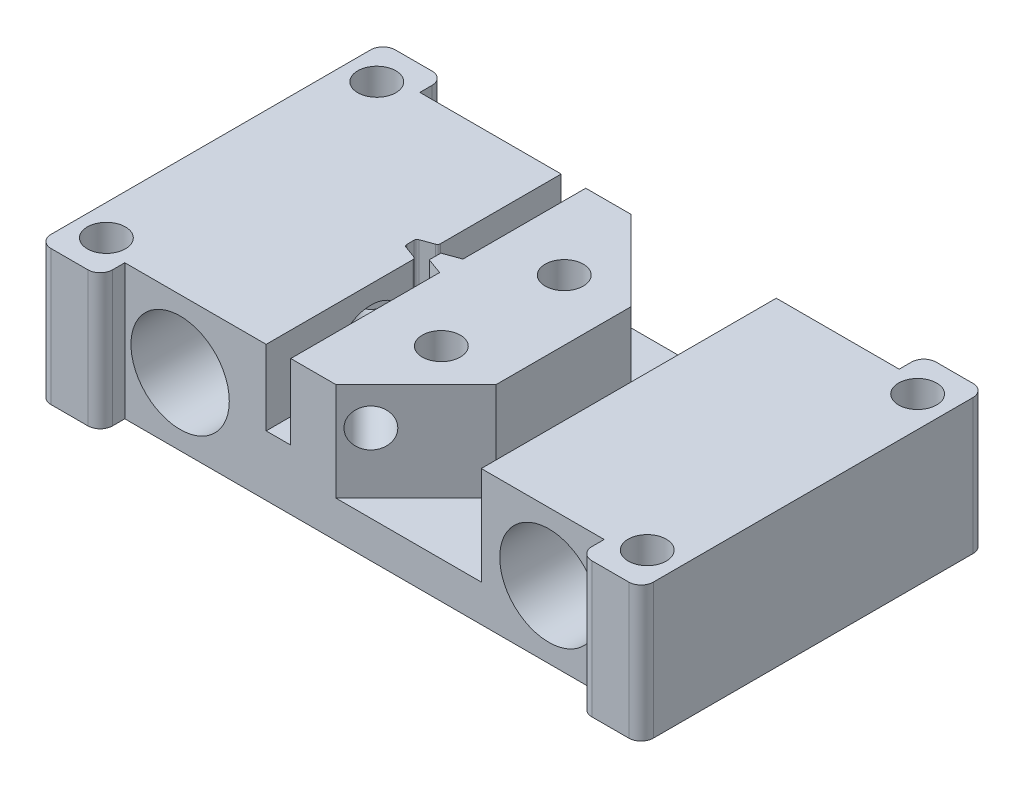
ISO-10303-21;
HEADER;
FILE_DESCRIPTION(('STEP AP214'),'2;1');
FILE_NAME('part.step','',(''),(''),'','','');
FILE_SCHEMA(('AUTOMOTIVE_DESIGN { 1 0 10303 214 1 1 1 1 }'));
ENDSEC;
DATA;
#1=APPLICATION_CONTEXT('core data for automotive mechanical design processes');
#2=APPLICATION_PROTOCOL_DEFINITION('international standard','automotive_design',2000,#1);
#3=PRODUCT_CONTEXT('',#1,'mechanical');
#4=PRODUCT('Part','Part','',(#3));
#5=PRODUCT_RELATED_PRODUCT_CATEGORY('part','',(#4));
#6=PRODUCT_DEFINITION_FORMATION('','',#4);
#7=PRODUCT_DEFINITION_CONTEXT('part definition',#1,'design');
#8=PRODUCT_DEFINITION('design','',#6,#7);
#9=PRODUCT_DEFINITION_SHAPE('','',#8);
#10=(LENGTH_UNIT() NAMED_UNIT(*) SI_UNIT(.MILLI.,.METRE.));
#11=(NAMED_UNIT(*) PLANE_ANGLE_UNIT() SI_UNIT($,.RADIAN.));
#12=(NAMED_UNIT(*) SI_UNIT($,.STERADIAN.) SOLID_ANGLE_UNIT());
#13=UNCERTAINTY_MEASURE_WITH_UNIT(LENGTH_MEASURE(1.E-05),#10,'distance_accuracy_value','');
#14=(GEOMETRIC_REPRESENTATION_CONTEXT(3) GLOBAL_UNCERTAINTY_ASSIGNED_CONTEXT((#13)) GLOBAL_UNIT_ASSIGNED_CONTEXT((#10,
#11,#12)) REPRESENTATION_CONTEXT('',''));
#15=CARTESIAN_POINT('',(0.,0.,0.));
#16=DIRECTION('',(0.,0.,1.));
#17=DIRECTION('',(1.,0.,0.));
#18=AXIS2_PLACEMENT_3D('',#15,#16,#17);
#19=CARTESIAN_POINT('',(0.,0.,0.));
#20=DIRECTION('',(0.,0.,-1.));
#21=DIRECTION('',(-1.,0.,0.));
#22=AXIS2_PLACEMENT_3D('',#19,#20,#21);
#23=PLANE('',#22);
#24=DIRECTION('',(0.,1.,0.));
#25=VECTOR('',#24,1.);
#26=CARTESIAN_POINT('',(19.5,-5.5,0.));
#27=LINE('',#26,#25);
#28=CARTESIAN_POINT('',(19.5,-5.5,0.));
#29=VERTEX_POINT('',#28);
#30=CARTESIAN_POINT('',(19.5,5.5,0.));
#31=VERTEX_POINT('',#30);
#32=EDGE_CURVE('E650',#29,#31,#27,.T.);
#33=ORIENTED_EDGE('',*,*,#32,.F.);
#34=DIRECTION('',(1.,0.,0.));
#35=VECTOR('',#34,1.);
#36=CARTESIAN_POINT('',(-24.5,-5.5,0.));
#37=LINE('',#36,#35);
#38=CARTESIAN_POINT('',(-19.5,-5.5,0.));
#39=VERTEX_POINT('',#38);
#40=EDGE_CURVE('E712',#39,#29,#37,.T.);
#41=ORIENTED_EDGE('',*,*,#40,.F.);
#42=DIRECTION('',(0.,1.,0.));
#43=VECTOR('',#42,1.);
#44=CARTESIAN_POINT('',(-19.5,-5.5,0.));
#45=LINE('',#44,#43);
#46=CARTESIAN_POINT('',(-19.5,5.5,0.));
#47=VERTEX_POINT('',#46);
#48=EDGE_CURVE('E660',#39,#47,#45,.T.);
#49=ORIENTED_EDGE('',*,*,#48,.T.);
#50=DIRECTION('',(-1.,0.,0.));
#51=VECTOR('',#50,1.);
#52=CARTESIAN_POINT('',(-24.5,5.5,0.));
#53=LINE('',#52,#51);
#54=CARTESIAN_POINT('',(-8.,5.5,0.));
#55=VERTEX_POINT('',#54);
#56=EDGE_CURVE('E714',#55,#47,#53,.T.);
#57=ORIENTED_EDGE('',*,*,#56,.F.);
#58=DIRECTION('',(0.,1.,0.));
#59=VECTOR('',#58,1.);
#60=CARTESIAN_POINT('',(-8.,-0.6,0.));
#61=LINE('',#60,#59);
#62=CARTESIAN_POINT('',(-8.,-0.6,0.));
#63=VERTEX_POINT('',#62);
#64=EDGE_CURVE('E849',#63,#55,#61,.T.);
#65=ORIENTED_EDGE('',*,*,#64,.F.);
#66=DIRECTION('',(-1.,0.,0.));
#67=VECTOR('',#66,1.);
#68=CARTESIAN_POINT('',(-8.,-0.6,0.));
#69=LINE('',#68,#67);
#70=CARTESIAN_POINT('',(-6.,-0.6,0.));
#71=VERTEX_POINT('',#70);
#72=EDGE_CURVE('E810',#71,#63,#69,.T.);
#73=ORIENTED_EDGE('',*,*,#72,.F.);
#74=DIRECTION('',(0.,1.,0.));
#75=VECTOR('',#74,1.);
#76=CARTESIAN_POINT('',(-6.,-0.6,0.));
#77=LINE('',#76,#75);
#78=CARTESIAN_POINT('',(-6.,5.5,0.));
#79=VERTEX_POINT('',#78);
#80=EDGE_CURVE('E852',#71,#79,#77,.T.);
#81=ORIENTED_EDGE('',*,*,#80,.T.);
#82=CARTESIAN_POINT('',(-2.31019320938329,5.5,0.));
#83=VERTEX_POINT('',#82);
#84=EDGE_CURVE('E716',#83,#79,#53,.T.);
#85=ORIENTED_EDGE('',*,*,#84,.F.);
#86=DIRECTION('',(0.,1.,0.));
#87=VECTOR('',#86,1.);
#88=CARTESIAN_POINT('',(-2.31019320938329,-2.5,0.));
#89=LINE('',#88,#87);
#90=CARTESIAN_POINT('',(-2.31019320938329,-2.5,0.));
#91=VERTEX_POINT('',#90);
#92=EDGE_CURVE('E761',#91,#83,#89,.T.);
#93=ORIENTED_EDGE('',*,*,#92,.F.);
#94=DIRECTION('',(-1.,0.,0.));
#95=VECTOR('',#94,1.);
#96=CARTESIAN_POINT('',(-2.31019320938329,-2.5,0.));
#97=LINE('',#96,#95);
#98=CARTESIAN_POINT('',(9.5,-2.5,0.));
#99=VERTEX_POINT('',#98);
#100=EDGE_CURVE('E667',#99,#91,#97,.T.);
#101=ORIENTED_EDGE('',*,*,#100,.F.);
#102=DIRECTION('',(0.,1.,0.));
#103=VECTOR('',#102,1.);
#104=CARTESIAN_POINT('',(9.5,-2.5,0.));
#105=LINE('',#104,#103);
#106=CARTESIAN_POINT('',(9.5,5.5,0.));
#107=VERTEX_POINT('',#106);
#108=EDGE_CURVE('E738',#99,#107,#105,.T.);
#109=ORIENTED_EDGE('',*,*,#108,.T.);
#110=EDGE_CURVE('E607',#31,#107,#53,.T.);
#111=ORIENTED_EDGE('',*,*,#110,.F.);
#112=EDGE_LOOP('',(#33,#41,#49,#57,#65,#73,#81,#85,#93,#101,#109,#111));
#113=FACE_BOUND('',#112,.T.);
#114=CARTESIAN_POINT('',(-15.,0.,0.));
#115=DIRECTION('',(0.,0.,1.));
#116=DIRECTION('',(1.,0.,0.));
#117=AXIS2_PLACEMENT_3D('',#114,#115,#116);
#118=CIRCLE('',#117,4.);
#119=CARTESIAN_POINT('',(-11.,0.,0.));
#120=VERTEX_POINT('',#119);
#121=EDGE_CURVE('E613',#120,#120,#118,.T.);
#122=ORIENTED_EDGE('',*,*,#121,.T.);
#123=EDGE_LOOP('',(#122));
#124=FACE_BOUND('',#123,.T.);
#125=CARTESIAN_POINT('',(15.,0.,0.));
#126=DIRECTION('',(0.,0.,1.));
#127=DIRECTION('',(1.,0.,0.));
#128=AXIS2_PLACEMENT_3D('',#125,#126,#127);
#129=CIRCLE('',#128,4.);
#130=CARTESIAN_POINT('',(19.,0.,0.));
#131=VERTEX_POINT('',#130);
#132=EDGE_CURVE('E851',#131,#131,#129,.T.);
#133=ORIENTED_EDGE('',*,*,#132,.T.);
#134=EDGE_LOOP('',(#133));
#135=FACE_BOUND('',#134,.T.);
#136=ADVANCED_FACE('F37',(#113,#124,#135),#23,.T.);
#137=CARTESIAN_POINT('',(-24.5,5.5,24.));
#138=DIRECTION('',(0.,-1.,0.));
#139=DIRECTION('',(0.,0.,-1.));
#140=AXIS2_PLACEMENT_3D('',#137,#138,#139);
#141=PLANE('',#140);
#142=CARTESIAN_POINT('',(22.,5.5,1.));
#143=DIRECTION('',(0.,-1.,0.));
#144=DIRECTION('',(0.,0.,-1.));
#145=AXIS2_PLACEMENT_3D('',#142,#143,#144);
#146=CIRCLE('',#145,1.55);
#147=CARTESIAN_POINT('',(22.,5.5,-0.549999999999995));
#148=VERTEX_POINT('',#147);
#149=EDGE_CURVE('E1491',#148,#148,#146,.T.);
#150=ORIENTED_EDGE('',*,*,#149,.T.);
#151=EDGE_LOOP('',(#150));
#152=FACE_BOUND('',#151,.T.);
#153=CARTESIAN_POINT('',(22.,5.5,23.));
#154=DIRECTION('',(0.,-1.,0.));
#155=DIRECTION('',(0.,0.,-1.));
#156=AXIS2_PLACEMENT_3D('',#153,#154,#155);
#157=CIRCLE('',#156,1.55);
#158=CARTESIAN_POINT('',(22.,5.5,21.45));
#159=VERTEX_POINT('',#158);
#160=EDGE_CURVE('E1485',#159,#159,#157,.T.);
#161=ORIENTED_EDGE('',*,*,#160,.T.);
#162=EDGE_LOOP('',(#161));
#163=FACE_BOUND('',#162,.T.);
#164=DIRECTION('',(0.,0.,1.));
#165=VECTOR('',#164,1.);
#166=CARTESIAN_POINT('',(19.5,5.5,24.));
#167=LINE('',#166,#165);
#168=CARTESIAN_POINT('',(19.5,5.5,24.));
#169=VERTEX_POINT('',#168);
#170=CARTESIAN_POINT('',(19.5,5.5,25.));
#171=VERTEX_POINT('',#170);
#172=EDGE_CURVE('E627',#169,#171,#167,.T.);
#173=ORIENTED_EDGE('',*,*,#172,.T.);
#174=CARTESIAN_POINT('',(20.5,5.5,25.));
#175=DIRECTION('',(0.,-1.,0.));
#176=DIRECTION('',(0.,0.,-1.));
#177=AXIS2_PLACEMENT_3D('',#174,#175,#176);
#178=CIRCLE('',#177,1.);
#179=CARTESIAN_POINT('',(20.5,5.5,26.));
#180=VERTEX_POINT('',#179);
#181=EDGE_CURVE('E556',#171,#180,#178,.F.);
#182=ORIENTED_EDGE('',*,*,#181,.T.);
#183=DIRECTION('',(1.,0.,0.));
#184=VECTOR('',#183,1.);
#185=CARTESIAN_POINT('',(24.5,5.5,26.));
#186=LINE('',#185,#184);
#187=CARTESIAN_POINT('',(23.5,5.5,26.));
#188=VERTEX_POINT('',#187);
#189=EDGE_CURVE('E630',#180,#188,#186,.T.);
#190=ORIENTED_EDGE('',*,*,#189,.T.);
#191=CARTESIAN_POINT('',(23.5,5.5,25.));
#192=DIRECTION('',(0.,-1.,0.));
#193=DIRECTION('',(0.,0.,-1.));
#194=AXIS2_PLACEMENT_3D('',#191,#192,#193);
#195=CIRCLE('',#194,1.);
#196=CARTESIAN_POINT('',(24.5,5.5,25.));
#197=VERTEX_POINT('',#196);
#198=EDGE_CURVE('E59',#188,#197,#195,.F.);
#199=ORIENTED_EDGE('',*,*,#198,.T.);
#200=DIRECTION('',(0.,0.,-1.));
#201=VECTOR('',#200,1.);
#202=CARTESIAN_POINT('',(24.5,5.5,24.));
#203=LINE('',#202,#201);
#204=CARTESIAN_POINT('',(24.5,5.5,-1.));
#205=VERTEX_POINT('',#204);
#206=EDGE_CURVE('E702',#197,#205,#203,.T.);
#207=ORIENTED_EDGE('',*,*,#206,.T.);
#208=CARTESIAN_POINT('',(23.5,5.5,-1.));
#209=DIRECTION('',(0.,-1.,0.));
#210=DIRECTION('',(0.,0.,-1.));
#211=AXIS2_PLACEMENT_3D('',#208,#209,#210);
#212=CIRCLE('',#211,1.);
#213=CARTESIAN_POINT('',(23.5,5.5,-2.));
#214=VERTEX_POINT('',#213);
#215=EDGE_CURVE('E561',#205,#214,#212,.F.);
#216=ORIENTED_EDGE('',*,*,#215,.T.);
#217=DIRECTION('',(-1.,0.,0.));
#218=VECTOR('',#217,1.);
#219=CARTESIAN_POINT('',(24.5,5.5,-2.));
#220=LINE('',#219,#218);
#221=CARTESIAN_POINT('',(20.5,5.5,-2.));
#222=VERTEX_POINT('',#221);
#223=EDGE_CURVE('E637',#214,#222,#220,.T.);
#224=ORIENTED_EDGE('',*,*,#223,.T.);
#225=CARTESIAN_POINT('',(20.5,5.5,-1.));
#226=DIRECTION('',(0.,-1.,0.));
#227=DIRECTION('',(0.,0.,-1.));
#228=AXIS2_PLACEMENT_3D('',#225,#226,#227);
#229=CIRCLE('',#228,1.);
#230=CARTESIAN_POINT('',(19.5,5.5,-1.));
#231=VERTEX_POINT('',#230);
#232=EDGE_CURVE('E559',#222,#231,#229,.F.);
#233=ORIENTED_EDGE('',*,*,#232,.T.);
#234=DIRECTION('',(0.,0.,1.));
#235=VECTOR('',#234,1.);
#236=CARTESIAN_POINT('',(19.5,5.5,0.));
#237=LINE('',#236,#235);
#238=EDGE_CURVE('E648',#231,#31,#237,.T.);
#239=ORIENTED_EDGE('',*,*,#238,.T.);
#240=ORIENTED_EDGE('',*,*,#110,.T.);
#241=DIRECTION('',(0.,0.,-1.));
#242=VECTOR('',#241,1.);
#243=CARTESIAN_POINT('',(9.5,5.5,0.));
#244=LINE('',#243,#242);
#245=CARTESIAN_POINT('',(9.5,5.5,24.));
#246=VERTEX_POINT('',#245);
#247=EDGE_CURVE('E730',#246,#107,#244,.T.);
#248=ORIENTED_EDGE('',*,*,#247,.F.);
#249=DIRECTION('',(-1.,0.,0.));
#250=VECTOR('',#249,1.);
#251=CARTESIAN_POINT('',(-24.5,5.5,24.));
#252=LINE('',#251,#250);
#253=EDGE_CURVE('E618',#169,#246,#252,.T.);
#254=ORIENTED_EDGE('',*,*,#253,.F.);
#255=EDGE_LOOP('',(#173,#182,#190,#199,#207,#216,#224,#233,#239,#240,#248,#254));
#256=FACE_BOUND('',#255,.T.);
#257=ADVANCED_FACE('F728',(#152,#163,#256),#141,.F.);
#258=CARTESIAN_POINT('',(-0.749999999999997,5.5,17.));
#259=DIRECTION('',(0.,1.,0.));
#260=DIRECTION('',(0.,0.,1.));
#261=AXIS2_PLACEMENT_3D('',#258,#259,#260);
#262=CIRCLE('',#261,1.55);
#263=CARTESIAN_POINT('',(-0.749999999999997,5.5,18.55));
#264=VERTEX_POINT('',#263);
#265=EDGE_CURVE('E531',#264,#264,#262,.T.);
#266=ORIENTED_EDGE('',*,*,#265,.F.);
#267=EDGE_LOOP('',(#266));
#268=FACE_BOUND('',#267,.T.);
#269=CARTESIAN_POINT('',(-0.749999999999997,5.5,7.));
#270=DIRECTION('',(0.,1.,0.));
#271=DIRECTION('',(0.,0.,1.));
#272=AXIS2_PLACEMENT_3D('',#269,#270,#271);
#273=CIRCLE('',#272,1.55);
#274=CARTESIAN_POINT('',(-0.749999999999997,5.5,8.55));
#275=VERTEX_POINT('',#274);
#276=EDGE_CURVE('E1504',#275,#275,#273,.T.);
#277=ORIENTED_EDGE('',*,*,#276,.F.);
#278=EDGE_LOOP('',(#277));
#279=FACE_BOUND('',#278,.T.);
#280=CARTESIAN_POINT('',(-2.31019320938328,5.5,24.));
#281=VERTEX_POINT('',#280);
#282=CARTESIAN_POINT('',(-6.,5.5,24.));
#283=VERTEX_POINT('',#282);
#284=EDGE_CURVE('E615',#281,#283,#252,.T.);
#285=ORIENTED_EDGE('',*,*,#284,.F.);
#286=DIRECTION('',(-0.707106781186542,0.,0.707106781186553));
#287=VECTOR('',#286,1.);
#288=CARTESIAN_POINT('',(4.1898067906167,5.5,17.4999999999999));
#289=LINE('',#288,#287);
#290=CARTESIAN_POINT('',(4.1898067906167,5.5,17.4999999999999));
#291=VERTEX_POINT('',#290);
#292=EDGE_CURVE('E742',#291,#281,#289,.T.);
#293=ORIENTED_EDGE('',*,*,#292,.F.);
#294=DIRECTION('',(0.,0.,1.));
#295=VECTOR('',#294,1.);
#296=CARTESIAN_POINT('',(4.18980679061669,5.5,6.49999999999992));
#297=LINE('',#296,#295);
#298=CARTESIAN_POINT('',(4.18980679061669,5.5,6.49999999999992));
#299=VERTEX_POINT('',#298);
#300=EDGE_CURVE('E1435',#299,#291,#297,.T.);
#301=ORIENTED_EDGE('',*,*,#300,.F.);
#302=DIRECTION('',(0.707106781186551,0.,0.707106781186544));
#303=VECTOR('',#302,1.);
#304=CARTESIAN_POINT('',(4.18980679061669,5.5,6.49999999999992));
#305=LINE('',#304,#303);
#306=EDGE_CURVE('E672',#83,#299,#305,.T.);
#307=ORIENTED_EDGE('',*,*,#306,.F.);
#308=ORIENTED_EDGE('',*,*,#84,.T.);
#309=DIRECTION('',(0.,0.,-1.));
#310=VECTOR('',#309,1.);
#311=CARTESIAN_POINT('',(-6.,5.5,0.));
#312=LINE('',#311,#310);
#313=CARTESIAN_POINT('',(-6.,5.5,9.98991166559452));
#314=VERTEX_POINT('',#313);
#315=EDGE_CURVE('E768',#314,#79,#312,.T.);
#316=ORIENTED_EDGE('',*,*,#315,.F.);
#317=DIRECTION('',(0.939692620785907,0.,-0.342020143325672));
#318=VECTOR('',#317,1.);
#319=CARTESIAN_POINT('',(-7.32000000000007,5.5,10.4703523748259));
#320=LINE('',#319,#318);
#321=CARTESIAN_POINT('',(-7.32000000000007,5.5,10.4703523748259));
#322=VERTEX_POINT('',#321);
#323=EDGE_CURVE('E845',#322,#314,#320,.T.);
#324=ORIENTED_EDGE('',*,*,#323,.F.);
#325=DIRECTION('',(0.,0.,-1.));
#326=VECTOR('',#325,1.);
#327=CARTESIAN_POINT('',(-7.32000000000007,5.5,10.4703523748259));
#328=LINE('',#327,#326);
#329=CARTESIAN_POINT('',(-7.32000000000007,5.5,11.407499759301));
#330=VERTEX_POINT('',#329);
#331=EDGE_CURVE('E842',#330,#322,#328,.T.);
#332=ORIENTED_EDGE('',*,*,#331,.F.);
#333=DIRECTION('',(-0.939692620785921,0.,-0.342020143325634));
#334=VECTOR('',#333,1.);
#335=CARTESIAN_POINT('',(-7.32000000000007,5.5,11.407499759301));
#336=LINE('',#335,#334);
#337=CARTESIAN_POINT('',(-6.,5.5,11.8879404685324));
#338=VERTEX_POINT('',#337);
#339=EDGE_CURVE('E839',#338,#330,#336,.T.);
#340=ORIENTED_EDGE('',*,*,#339,.F.);
#341=DIRECTION('',(0.,0.,-1.));
#342=VECTOR('',#341,1.);
#343=CARTESIAN_POINT('',(-6.,5.5,11.8879404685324));
#344=LINE('',#343,#342);
#345=EDGE_CURVE('E836',#283,#338,#344,.T.);
#346=ORIENTED_EDGE('',*,*,#345,.F.);
#347=EDGE_LOOP('',(#285,#293,#301,#307,#308,#316,#324,#332,#340,#346));
#348=FACE_BOUND('',#347,.T.);
#349=ADVANCED_FACE('F909',(#268,#279,#348),#141,.F.);
#350=CARTESIAN_POINT('',(-22.,5.5,1.));
#351=DIRECTION('',(0.,-1.,0.));
#352=DIRECTION('',(0.,0.,-1.));
#353=AXIS2_PLACEMENT_3D('',#350,#351,#352);
#354=CIRCLE('',#353,1.55);
#355=CARTESIAN_POINT('',(-22.,5.5,-0.549999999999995));
#356=VERTEX_POINT('',#355);
#357=EDGE_CURVE('E1497',#356,#356,#354,.T.);
#358=ORIENTED_EDGE('',*,*,#357,.T.);
#359=EDGE_LOOP('',(#358));
#360=FACE_BOUND('',#359,.T.);
#361=CARTESIAN_POINT('',(-22.,5.5,23.));
#362=DIRECTION('',(0.,-1.,0.));
#363=DIRECTION('',(0.,0.,-1.));
#364=AXIS2_PLACEMENT_3D('',#361,#362,#363);
#365=CIRCLE('',#364,1.55);
#366=CARTESIAN_POINT('',(-22.,5.5,21.45));
#367=VERTEX_POINT('',#366);
#368=EDGE_CURVE('E1477',#367,#367,#365,.T.);
#369=ORIENTED_EDGE('',*,*,#368,.T.);
#370=EDGE_LOOP('',(#369));
#371=FACE_BOUND('',#370,.T.);
#372=DIRECTION('',(0.,0.,-1.));
#373=VECTOR('',#372,1.);
#374=CARTESIAN_POINT('',(-24.5,5.5,24.));
#375=LINE('',#374,#373);
#376=CARTESIAN_POINT('',(-24.5,5.5,25.));
#377=VERTEX_POINT('',#376);
#378=CARTESIAN_POINT('',(-24.5,5.5,-1.));
#379=VERTEX_POINT('',#378);
#380=EDGE_CURVE('E624',#377,#379,#375,.T.);
#381=ORIENTED_EDGE('',*,*,#380,.F.);
#382=CARTESIAN_POINT('',(-23.5,5.5,25.));
#383=DIRECTION('',(0.,-1.,0.));
#384=DIRECTION('',(0.,0.,-1.));
#385=AXIS2_PLACEMENT_3D('',#382,#383,#384);
#386=CIRCLE('',#385,1.);
#387=CARTESIAN_POINT('',(-23.5,5.5,26.));
#388=VERTEX_POINT('',#387);
#389=EDGE_CURVE('E589',#377,#388,#386,.F.);
#390=ORIENTED_EDGE('',*,*,#389,.T.);
#391=DIRECTION('',(1.,0.,0.));
#392=VECTOR('',#391,1.);
#393=CARTESIAN_POINT('',(-24.5,5.5,26.));
#394=LINE('',#393,#392);
#395=CARTESIAN_POINT('',(-20.5,5.5,26.));
#396=VERTEX_POINT('',#395);
#397=EDGE_CURVE('E1475',#388,#396,#394,.T.);
#398=ORIENTED_EDGE('',*,*,#397,.T.);
#399=CARTESIAN_POINT('',(-20.5,5.5,25.));
#400=DIRECTION('',(0.,-1.,0.));
#401=DIRECTION('',(0.,0.,-1.));
#402=AXIS2_PLACEMENT_3D('',#399,#400,#401);
#403=CIRCLE('',#402,1.);
#404=CARTESIAN_POINT('',(-19.5,5.5,25.));
#405=VERTEX_POINT('',#404);
#406=EDGE_CURVE('E591',#396,#405,#403,.F.);
#407=ORIENTED_EDGE('',*,*,#406,.T.);
#408=DIRECTION('',(0.,0.,-1.));
#409=VECTOR('',#408,1.);
#410=CARTESIAN_POINT('',(-19.5,5.5,24.));
#411=LINE('',#410,#409);
#412=CARTESIAN_POINT('',(-19.5,5.5,24.));
#413=VERTEX_POINT('',#412);
#414=EDGE_CURVE('E1386',#405,#413,#411,.T.);
#415=ORIENTED_EDGE('',*,*,#414,.T.);
#416=CARTESIAN_POINT('',(-8.,5.5,24.));
#417=VERTEX_POINT('',#416);
#418=EDGE_CURVE('E606',#417,#413,#252,.T.);
#419=ORIENTED_EDGE('',*,*,#418,.F.);
#420=DIRECTION('',(0.,0.,1.));
#421=VECTOR('',#420,1.);
#422=CARTESIAN_POINT('',(-8.,5.5,12.0629923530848));
#423=LINE('',#422,#421);
#424=CARTESIAN_POINT('',(-8.,5.5,12.0629923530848));
#425=VERTEX_POINT('',#424);
#426=EDGE_CURVE('E834',#425,#417,#423,.T.);
#427=ORIENTED_EDGE('',*,*,#426,.F.);
#428=CARTESIAN_POINT('',(-8.25,5.5,12.0629923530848));
#429=DIRECTION('',(0.,-1.,0.));
#430=DIRECTION('',(0.,0.,-1.));
#431=AXIS2_PLACEMENT_3D('',#428,#429,#430);
#432=CIRCLE('',#431,0.249999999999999);
#433=CARTESIAN_POINT('',(-8.16449496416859,5.5,11.8280691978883));
#434=VERTEX_POINT('',#433);
#435=EDGE_CURVE('E831',#434,#425,#432,.T.);
#436=ORIENTED_EDGE('',*,*,#435,.F.);
#437=DIRECTION('',(0.939692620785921,0.,0.342020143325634));
#438=VECTOR('',#437,1.);
#439=CARTESIAN_POINT('',(-9.15550503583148,5.5,11.4673710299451));
#440=LINE('',#439,#438);
#441=CARTESIAN_POINT('',(-9.15550503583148,5.5,11.4673710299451));
#442=VERTEX_POINT('',#441);
#443=EDGE_CURVE('E828',#442,#434,#440,.T.);
#444=ORIENTED_EDGE('',*,*,#443,.F.);
#445=CARTESIAN_POINT('',(-9.07000000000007,5.5,11.2324478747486));
#446=DIRECTION('',(0.,1.,0.));
#447=DIRECTION('',(0.,0.,1.));
#448=AXIS2_PLACEMENT_3D('',#445,#446,#447);
#449=CIRCLE('',#448,0.25);
#450=CARTESIAN_POINT('',(-9.32000000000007,5.5,11.2324478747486));
#451=VERTEX_POINT('',#450);
#452=EDGE_CURVE('E825',#451,#442,#449,.T.);
#453=ORIENTED_EDGE('',*,*,#452,.F.);
#454=DIRECTION('',(0.,0.,1.));
#455=VECTOR('',#454,1.);
#456=CARTESIAN_POINT('',(-9.32000000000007,5.5,10.6454042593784));
#457=LINE('',#456,#455);
#458=CARTESIAN_POINT('',(-9.32000000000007,5.5,10.6454042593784));
#459=VERTEX_POINT('',#458);
#460=EDGE_CURVE('E822',#459,#451,#457,.T.);
#461=ORIENTED_EDGE('',*,*,#460,.F.);
#462=CARTESIAN_POINT('',(-9.07000000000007,5.5,10.6454042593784));
#463=DIRECTION('',(0.,1.,0.));
#464=DIRECTION('',(0.,0.,1.));
#465=AXIS2_PLACEMENT_3D('',#462,#463,#464);
#466=CIRCLE('',#465,0.25);
#467=CARTESIAN_POINT('',(-9.15550503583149,5.5,10.4104811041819));
#468=VERTEX_POINT('',#467);
#469=EDGE_CURVE('E819',#468,#459,#466,.T.);
#470=ORIENTED_EDGE('',*,*,#469,.F.);
#471=DIRECTION('',(-0.939692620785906,0.,0.342020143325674));
#472=VECTOR('',#471,1.);
#473=CARTESIAN_POINT('',(-8.16449496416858,5.5,10.0497829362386));
#474=LINE('',#473,#472);
#475=CARTESIAN_POINT('',(-8.16449496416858,5.5,10.0497829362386));
#476=VERTEX_POINT('',#475);
#477=EDGE_CURVE('E816',#476,#468,#474,.T.);
#478=ORIENTED_EDGE('',*,*,#477,.F.);
#479=CARTESIAN_POINT('',(-8.25,5.5,9.81485978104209));
#480=DIRECTION('',(0.,-1.,0.));
#481=DIRECTION('',(0.,0.,1.));
#482=AXIS2_PLACEMENT_3D('',#479,#480,#481);
#483=CIRCLE('',#482,0.25);
#484=CARTESIAN_POINT('',(-8.,5.5,9.81485978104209));
#485=VERTEX_POINT('',#484);
#486=EDGE_CURVE('E749',#485,#476,#483,.T.);
#487=ORIENTED_EDGE('',*,*,#486,.F.);
#488=DIRECTION('',(0.,0.,1.));
#489=VECTOR('',#488,1.);
#490=CARTESIAN_POINT('',(-8.,5.5,0.));
#491=LINE('',#490,#489);
#492=EDGE_CURVE('E747',#55,#485,#491,.T.);
#493=ORIENTED_EDGE('',*,*,#492,.F.);
#494=ORIENTED_EDGE('',*,*,#56,.T.);
#495=DIRECTION('',(0.,0.,-1.));
#496=VECTOR('',#495,1.);
#497=CARTESIAN_POINT('',(-19.5,5.5,0.));
#498=LINE('',#497,#496);
#499=CARTESIAN_POINT('',(-19.5,5.5,-1.));
#500=VERTEX_POINT('',#499);
#501=EDGE_CURVE('E656',#47,#500,#498,.T.);
#502=ORIENTED_EDGE('',*,*,#501,.T.);
#503=CARTESIAN_POINT('',(-20.5,5.5,-1.));
#504=DIRECTION('',(0.,-1.,0.));
#505=DIRECTION('',(0.,0.,-1.));
#506=AXIS2_PLACEMENT_3D('',#503,#504,#505);
#507=CIRCLE('',#506,1.);
#508=CARTESIAN_POINT('',(-20.5,5.5,-2.));
#509=VERTEX_POINT('',#508);
#510=EDGE_CURVE('E593',#500,#509,#507,.F.);
#511=ORIENTED_EDGE('',*,*,#510,.T.);
#512=DIRECTION('',(-1.,0.,0.));
#513=VECTOR('',#512,1.);
#514=CARTESIAN_POINT('',(-24.5,5.5,-2.));
#515=LINE('',#514,#513);
#516=CARTESIAN_POINT('',(-23.5,5.5,-2.));
#517=VERTEX_POINT('',#516);
#518=EDGE_CURVE('E662',#509,#517,#515,.T.);
#519=ORIENTED_EDGE('',*,*,#518,.T.);
#520=CARTESIAN_POINT('',(-23.5,5.5,-1.));
#521=DIRECTION('',(0.,-1.,0.));
#522=DIRECTION('',(0.,0.,-1.));
#523=AXIS2_PLACEMENT_3D('',#520,#521,#522);
#524=CIRCLE('',#523,1.);
#525=EDGE_CURVE('E595',#517,#379,#524,.F.);
#526=ORIENTED_EDGE('',*,*,#525,.T.);
#527=EDGE_LOOP('',(#381,#390,#398,#407,#415,#419,#427,#436,#444,#453,#461,#470,#478,#487,#493,
#494,#502,#511,#519,#526));
#528=FACE_BOUND('',#527,.T.);
#529=ADVANCED_FACE('F689',(#360,#371,#528),#141,.F.);
#530=CARTESIAN_POINT('',(0.,0.,24.));
#531=DIRECTION('',(0.,0.,-1.));
#532=DIRECTION('',(-1.,0.,0.));
#533=AXIS2_PLACEMENT_3D('',#530,#531,#532);
#534=PLANE('',#533);
#535=ORIENTED_EDGE('',*,*,#418,.T.);
#536=DIRECTION('',(0.,1.,0.));
#537=VECTOR('',#536,1.);
#538=CARTESIAN_POINT('',(-19.5,-5.5,24.));
#539=LINE('',#538,#537);
#540=CARTESIAN_POINT('',(-19.5,-5.5,24.));
#541=VERTEX_POINT('',#540);
#542=EDGE_CURVE('E631',#541,#413,#539,.T.);
#543=ORIENTED_EDGE('',*,*,#542,.F.);
#544=DIRECTION('',(1.,0.,0.));
#545=VECTOR('',#544,1.);
#546=CARTESIAN_POINT('',(-24.5,-5.5,24.));
#547=LINE('',#546,#545);
#548=CARTESIAN_POINT('',(19.5,-5.5,24.));
#549=VERTEX_POINT('',#548);
#550=EDGE_CURVE('E603',#541,#549,#547,.T.);
#551=ORIENTED_EDGE('',*,*,#550,.T.);
#552=DIRECTION('',(0.,1.,0.));
#553=VECTOR('',#552,1.);
#554=CARTESIAN_POINT('',(19.5,-5.5,24.));
#555=LINE('',#554,#553);
#556=EDGE_CURVE('E634',#549,#169,#555,.T.);
#557=ORIENTED_EDGE('',*,*,#556,.T.);
#558=ORIENTED_EDGE('',*,*,#253,.T.);
#559=DIRECTION('',(0.,1.,0.));
#560=VECTOR('',#559,1.);
#561=CARTESIAN_POINT('',(9.5,-2.5,24.));
#562=LINE('',#561,#560);
#563=CARTESIAN_POINT('',(9.5,-2.5,24.));
#564=VERTEX_POINT('',#563);
#565=EDGE_CURVE('E741',#564,#246,#562,.T.);
#566=ORIENTED_EDGE('',*,*,#565,.F.);
#567=DIRECTION('',(1.,0.,0.));
#568=VECTOR('',#567,1.);
#569=CARTESIAN_POINT('',(-2.31019320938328,-2.5,24.));
#570=LINE('',#569,#568);
#571=CARTESIAN_POINT('',(-2.31019320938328,-2.5,24.));
#572=VERTEX_POINT('',#571);
#573=EDGE_CURVE('E1445',#572,#564,#570,.T.);
#574=ORIENTED_EDGE('',*,*,#573,.F.);
#575=DIRECTION('',(0.,1.,0.));
#576=VECTOR('',#575,1.);
#577=CARTESIAN_POINT('',(-2.31019320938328,-2.5,24.));
#578=LINE('',#577,#576);
#579=EDGE_CURVE('E751',#572,#281,#578,.T.);
#580=ORIENTED_EDGE('',*,*,#579,.T.);
#581=ORIENTED_EDGE('',*,*,#284,.T.);
#582=DIRECTION('',(0.,1.,0.));
#583=VECTOR('',#582,1.);
#584=CARTESIAN_POINT('',(-6.,-0.6,24.));
#585=LINE('',#584,#583);
#586=CARTESIAN_POINT('',(-6.,-0.6,24.));
#587=VERTEX_POINT('',#586);
#588=EDGE_CURVE('E863',#587,#283,#585,.T.);
#589=ORIENTED_EDGE('',*,*,#588,.F.);
#590=DIRECTION('',(1.,0.,0.));
#591=VECTOR('',#590,1.);
#592=CARTESIAN_POINT('',(-8.,-0.6,24.));
#593=LINE('',#592,#591);
#594=CARTESIAN_POINT('',(-8.,-0.6,24.));
#595=VERTEX_POINT('',#594);
#596=EDGE_CURVE('E792',#595,#587,#593,.T.);
#597=ORIENTED_EDGE('',*,*,#596,.F.);
#598=DIRECTION('',(0.,1.,0.));
#599=VECTOR('',#598,1.);
#600=CARTESIAN_POINT('',(-8.,-0.6,24.));
#601=LINE('',#600,#599);
#602=EDGE_CURVE('E866',#595,#417,#601,.T.);
#603=ORIENTED_EDGE('',*,*,#602,.T.);
#604=EDGE_LOOP('',(#535,#543,#551,#557,#558,#566,#574,#580,#581,#589,#597,#603));
#605=FACE_BOUND('',#604,.T.);
#606=CARTESIAN_POINT('',(-15.,0.,24.));
#607=DIRECTION('',(0.,0.,1.));
#608=DIRECTION('',(1.,0.,0.));
#609=AXIS2_PLACEMENT_3D('',#606,#607,#608);
#610=CIRCLE('',#609,4.);
#611=CARTESIAN_POINT('',(-11.,0.,24.));
#612=VERTEX_POINT('',#611);
#613=EDGE_CURVE('E715',#612,#612,#610,.T.);
#614=ORIENTED_EDGE('',*,*,#613,.F.);
#615=EDGE_LOOP('',(#614));
#616=FACE_BOUND('',#615,.T.);
#617=CARTESIAN_POINT('',(15.,0.,24.));
#618=DIRECTION('',(0.,0.,1.));
#619=DIRECTION('',(1.,0.,0.));
#620=AXIS2_PLACEMENT_3D('',#617,#618,#619);
#621=CIRCLE('',#620,4.);
#622=CARTESIAN_POINT('',(19.,0.,24.));
#623=VERTEX_POINT('',#622);
#624=EDGE_CURVE('E885',#623,#623,#621,.T.);
#625=ORIENTED_EDGE('',*,*,#624,.F.);
#626=EDGE_LOOP('',(#625));
#627=FACE_BOUND('',#626,.T.);
#628=ADVANCED_FACE('F912',(#605,#616,#627),#534,.F.);
#629=CARTESIAN_POINT('',(-24.5,-5.5,24.));
#630=DIRECTION('',(1.,0.,0.));
#631=DIRECTION('',(0.,0.,-1.));
#632=AXIS2_PLACEMENT_3D('',#629,#630,#631);
#633=PLANE('',#632);
#634=DIRECTION('',(0.,0.,-1.));
#635=VECTOR('',#634,1.);
#636=CARTESIAN_POINT('',(-24.5,-5.5,24.));
#637=LINE('',#636,#635);
#638=CARTESIAN_POINT('',(-24.5,-5.5,25.));
#639=VERTEX_POINT('',#638);
#640=CARTESIAN_POINT('',(-24.5,-5.5,-1.));
#641=VERTEX_POINT('',#640);
#642=EDGE_CURVE('E602',#639,#641,#637,.T.);
#643=ORIENTED_EDGE('',*,*,#642,.F.);
#644=DIRECTION('',(0.,1.,0.));
#645=VECTOR('',#644,1.);
#646=CARTESIAN_POINT('',(-24.5,5.5,25.));
#647=LINE('',#646,#645);
#648=EDGE_CURVE('E597',#639,#377,#647,.T.);
#649=ORIENTED_EDGE('',*,*,#648,.T.);
#650=ORIENTED_EDGE('',*,*,#380,.T.);
#651=DIRECTION('',(0.,1.,0.));
#652=VECTOR('',#651,1.);
#653=CARTESIAN_POINT('',(-24.5,-5.5,-1.));
#654=LINE('',#653,#652);
#655=EDGE_CURVE('E600',#379,#641,#654,.F.);
#656=ORIENTED_EDGE('',*,*,#655,.T.);
#657=EDGE_LOOP('',(#643,#649,#650,#656));
#658=FACE_BOUND('',#657,.T.);
#659=ADVANCED_FACE('F699',(#658),#633,.F.);
#660=CARTESIAN_POINT('',(-24.5,-5.5,24.));
#661=DIRECTION('',(0.,1.,0.));
#662=DIRECTION('',(0.,0.,1.));
#663=AXIS2_PLACEMENT_3D('',#660,#661,#662);
#664=PLANE('',#663);
#665=CARTESIAN_POINT('',(-15.,-5.5,7.));
#666=DIRECTION('',(0.,-1.,0.));
#667=DIRECTION('',(0.,0.,-1.));
#668=AXIS2_PLACEMENT_3D('',#665,#666,#667);
#669=CIRCLE('',#668,1.55);
#670=CARTESIAN_POINT('',(-15.,-5.5,5.45));
#671=VERTEX_POINT('',#670);
#672=EDGE_CURVE('E322',#671,#671,#669,.T.);
#673=ORIENTED_EDGE('',*,*,#672,.F.);
#674=EDGE_LOOP('',(#673));
#675=FACE_BOUND('',#674,.T.);
#676=CARTESIAN_POINT('',(15.,-5.5,7.));
#677=DIRECTION('',(0.,-1.,0.));
#678=DIRECTION('',(0.,0.,-1.));
#679=AXIS2_PLACEMENT_3D('',#676,#677,#678);
#680=CIRCLE('',#679,1.55);
#681=CARTESIAN_POINT('',(15.,-5.5,5.45));
#682=VERTEX_POINT('',#681);
#683=EDGE_CURVE('E358',#682,#682,#680,.T.);
#684=ORIENTED_EDGE('',*,*,#683,.F.);
#685=EDGE_LOOP('',(#684));
#686=FACE_BOUND('',#685,.T.);
#687=CARTESIAN_POINT('',(15.,-5.5,17.));
#688=DIRECTION('',(0.,-1.,0.));
#689=DIRECTION('',(0.,0.,-1.));
#690=AXIS2_PLACEMENT_3D('',#687,#688,#689);
#691=CIRCLE('',#690,1.55);
#692=CARTESIAN_POINT('',(15.,-5.5,15.45));
#693=VERTEX_POINT('',#692);
#694=EDGE_CURVE('E364',#693,#693,#691,.T.);
#695=ORIENTED_EDGE('',*,*,#694,.F.);
#696=EDGE_LOOP('',(#695));
#697=FACE_BOUND('',#696,.T.);
#698=CARTESIAN_POINT('',(-15.,-5.5,17.));
#699=DIRECTION('',(0.,-1.,0.));
#700=DIRECTION('',(0.,0.,-1.));
#701=AXIS2_PLACEMENT_3D('',#698,#699,#700);
#702=CIRCLE('',#701,1.55);
#703=CARTESIAN_POINT('',(-15.,-5.5,15.45));
#704=VERTEX_POINT('',#703);
#705=EDGE_CURVE('E532',#704,#704,#702,.T.);
#706=ORIENTED_EDGE('',*,*,#705,.F.);
#707=EDGE_LOOP('',(#706));
#708=FACE_BOUND('',#707,.T.);
#709=CARTESIAN_POINT('',(-22.,-5.5,1.));
#710=DIRECTION('',(0.,-1.,0.));
#711=DIRECTION('',(0.,0.,-1.));
#712=AXIS2_PLACEMENT_3D('',#709,#710,#711);
#713=CIRCLE('',#712,1.55);
#714=CARTESIAN_POINT('',(-22.,-5.5,-0.549999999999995));
#715=VERTEX_POINT('',#714);
#716=EDGE_CURVE('E1500',#715,#715,#713,.T.);
#717=ORIENTED_EDGE('',*,*,#716,.F.);
#718=EDGE_LOOP('',(#717));
#719=FACE_BOUND('',#718,.T.);
#720=CARTESIAN_POINT('',(22.,-5.5,1.));
#721=DIRECTION('',(0.,-1.,0.));
#722=DIRECTION('',(0.,0.,-1.));
#723=AXIS2_PLACEMENT_3D('',#720,#721,#722);
#724=CIRCLE('',#723,1.55);
#725=CARTESIAN_POINT('',(22.,-5.5,-0.549999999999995));
#726=VERTEX_POINT('',#725);
#727=EDGE_CURVE('E1494',#726,#726,#724,.T.);
#728=ORIENTED_EDGE('',*,*,#727,.F.);
#729=EDGE_LOOP('',(#728));
#730=FACE_BOUND('',#729,.T.);
#731=CARTESIAN_POINT('',(22.,-5.5,23.));
#732=DIRECTION('',(0.,-1.,0.));
#733=DIRECTION('',(0.,0.,-1.));
#734=AXIS2_PLACEMENT_3D('',#731,#732,#733);
#735=CIRCLE('',#734,1.55);
#736=CARTESIAN_POINT('',(22.,-5.5,21.45));
#737=VERTEX_POINT('',#736);
#738=EDGE_CURVE('E1488',#737,#737,#735,.T.);
#739=ORIENTED_EDGE('',*,*,#738,.F.);
#740=EDGE_LOOP('',(#739));
#741=FACE_BOUND('',#740,.T.);
#742=CARTESIAN_POINT('',(-22.,-5.5,23.));
#743=DIRECTION('',(0.,-1.,0.));
#744=DIRECTION('',(0.,0.,-1.));
#745=AXIS2_PLACEMENT_3D('',#742,#743,#744);
#746=CIRCLE('',#745,1.55);
#747=CARTESIAN_POINT('',(-22.,-5.5,21.45));
#748=VERTEX_POINT('',#747);
#749=EDGE_CURVE('E1479',#748,#748,#746,.T.);
#750=ORIENTED_EDGE('',*,*,#749,.F.);
#751=EDGE_LOOP('',(#750));
#752=FACE_BOUND('',#751,.T.);
#753=DIRECTION('',(1.,0.,0.));
#754=VECTOR('',#753,1.);
#755=CARTESIAN_POINT('',(-24.5,-5.5,26.));
#756=LINE('',#755,#754);
#757=CARTESIAN_POINT('',(-23.5,-5.5,26.));
#758=VERTEX_POINT('',#757);
#759=CARTESIAN_POINT('',(-20.5,-5.5,26.));
#760=VERTEX_POINT('',#759);
#761=EDGE_CURVE('E1392',#758,#760,#756,.T.);
#762=ORIENTED_EDGE('',*,*,#761,.F.);
#763=CARTESIAN_POINT('',(-23.5,-5.5,25.));
#764=DIRECTION('',(0.,1.,0.));
#765=DIRECTION('',(0.,0.,1.));
#766=AXIS2_PLACEMENT_3D('',#763,#764,#765);
#767=CIRCLE('',#766,1.);
#768=EDGE_CURVE('E568',#758,#639,#767,.F.);
#769=ORIENTED_EDGE('',*,*,#768,.T.);
#770=ORIENTED_EDGE('',*,*,#642,.T.);
#771=CARTESIAN_POINT('',(-23.5,-5.5,-1.));
#772=DIRECTION('',(0.,1.,0.));
#773=DIRECTION('',(0.,0.,1.));
#774=AXIS2_PLACEMENT_3D('',#771,#772,#773);
#775=CIRCLE('',#774,1.);
#776=CARTESIAN_POINT('',(-23.5,-5.5,-2.));
#777=VERTEX_POINT('',#776);
#778=EDGE_CURVE('E582',#641,#777,#775,.F.);
#779=ORIENTED_EDGE('',*,*,#778,.T.);
#780=DIRECTION('',(-1.,0.,0.));
#781=VECTOR('',#780,1.);
#782=CARTESIAN_POINT('',(-24.5,-5.5,-2.));
#783=LINE('',#782,#781);
#784=CARTESIAN_POINT('',(-20.5,-5.5,-2.));
#785=VERTEX_POINT('',#784);
#786=EDGE_CURVE('E657',#785,#777,#783,.T.);
#787=ORIENTED_EDGE('',*,*,#786,.F.);
#788=CARTESIAN_POINT('',(-20.5,-5.5,-1.));
#789=DIRECTION('',(0.,1.,0.));
#790=DIRECTION('',(0.,0.,1.));
#791=AXIS2_PLACEMENT_3D('',#788,#789,#790);
#792=CIRCLE('',#791,1.);
#793=CARTESIAN_POINT('',(-19.5,-5.5,-1.));
#794=VERTEX_POINT('',#793);
#795=EDGE_CURVE('E580',#785,#794,#792,.F.);
#796=ORIENTED_EDGE('',*,*,#795,.T.);
#797=DIRECTION('',(0.,0.,-1.));
#798=VECTOR('',#797,1.);
#799=CARTESIAN_POINT('',(-19.5,-5.5,0.));
#800=LINE('',#799,#798);
#801=EDGE_CURVE('E661',#39,#794,#800,.T.);
#802=ORIENTED_EDGE('',*,*,#801,.F.);
#803=ORIENTED_EDGE('',*,*,#40,.T.);
#804=DIRECTION('',(0.,0.,1.));
#805=VECTOR('',#804,1.);
#806=CARTESIAN_POINT('',(19.5,-5.5,0.));
#807=LINE('',#806,#805);
#808=CARTESIAN_POINT('',(19.5,-5.5,-1.));
#809=VERTEX_POINT('',#808);
#810=EDGE_CURVE('E647',#809,#29,#807,.T.);
#811=ORIENTED_EDGE('',*,*,#810,.F.);
#812=CARTESIAN_POINT('',(20.5,-5.5,-1.));
#813=DIRECTION('',(0.,1.,0.));
#814=DIRECTION('',(0.,0.,1.));
#815=AXIS2_PLACEMENT_3D('',#812,#813,#814);
#816=CIRCLE('',#815,1.);
#817=CARTESIAN_POINT('',(20.5,-5.5,-2.));
#818=VERTEX_POINT('',#817);
#819=EDGE_CURVE('E576',#809,#818,#816,.F.);
#820=ORIENTED_EDGE('',*,*,#819,.T.);
#821=DIRECTION('',(-1.,0.,0.));
#822=VECTOR('',#821,1.);
#823=CARTESIAN_POINT('',(24.5,-5.5,-2.));
#824=LINE('',#823,#822);
#825=CARTESIAN_POINT('',(23.5,-5.5,-2.));
#826=VERTEX_POINT('',#825);
#827=EDGE_CURVE('E644',#826,#818,#824,.T.);
#828=ORIENTED_EDGE('',*,*,#827,.F.);
#829=CARTESIAN_POINT('',(23.5,-5.5,-1.));
#830=DIRECTION('',(0.,1.,0.));
#831=DIRECTION('',(0.,0.,1.));
#832=AXIS2_PLACEMENT_3D('',#829,#830,#831);
#833=CIRCLE('',#832,1.);
#834=CARTESIAN_POINT('',(24.5,-5.5,-1.));
#835=VERTEX_POINT('',#834);
#836=EDGE_CURVE('E578',#826,#835,#833,.F.);
#837=ORIENTED_EDGE('',*,*,#836,.T.);
#838=DIRECTION('',(0.,0.,-1.));
#839=VECTOR('',#838,1.);
#840=CARTESIAN_POINT('',(24.5,-5.5,24.));
#841=LINE('',#840,#839);
#842=CARTESIAN_POINT('',(24.5,-5.5,25.));
#843=VERTEX_POINT('',#842);
#844=EDGE_CURVE('E705',#843,#835,#841,.T.);
#845=ORIENTED_EDGE('',*,*,#844,.F.);
#846=CARTESIAN_POINT('',(23.5,-5.5,25.));
#847=DIRECTION('',(0.,1.,0.));
#848=DIRECTION('',(0.,0.,1.));
#849=AXIS2_PLACEMENT_3D('',#846,#847,#848);
#850=CIRCLE('',#849,1.);
#851=CARTESIAN_POINT('',(23.5,-5.5,26.));
#852=VERTEX_POINT('',#851);
#853=EDGE_CURVE('E574',#843,#852,#850,.F.);
#854=ORIENTED_EDGE('',*,*,#853,.T.);
#855=DIRECTION('',(1.,0.,0.));
#856=VECTOR('',#855,1.);
#857=CARTESIAN_POINT('',(24.5,-5.5,26.));
#858=LINE('',#857,#856);
#859=CARTESIAN_POINT('',(20.5,-5.5,26.));
#860=VERTEX_POINT('',#859);
#861=EDGE_CURVE('E638',#860,#852,#858,.T.);
#862=ORIENTED_EDGE('',*,*,#861,.F.);
#863=CARTESIAN_POINT('',(20.5,-5.5,25.));
#864=DIRECTION('',(0.,1.,0.));
#865=DIRECTION('',(0.,0.,1.));
#866=AXIS2_PLACEMENT_3D('',#863,#864,#865);
#867=CIRCLE('',#866,1.);
#868=CARTESIAN_POINT('',(19.5,-5.5,25.));
#869=VERTEX_POINT('',#868);
#870=EDGE_CURVE('E572',#860,#869,#867,.F.);
#871=ORIENTED_EDGE('',*,*,#870,.T.);
#872=DIRECTION('',(0.,0.,1.));
#873=VECTOR('',#872,1.);
#874=CARTESIAN_POINT('',(19.5,-5.5,24.));
#875=LINE('',#874,#873);
#876=EDGE_CURVE('E639',#549,#869,#875,.T.);
#877=ORIENTED_EDGE('',*,*,#876,.F.);
#878=ORIENTED_EDGE('',*,*,#550,.F.);
#879=DIRECTION('',(0.,0.,-1.));
#880=VECTOR('',#879,1.);
#881=CARTESIAN_POINT('',(-19.5,-5.5,24.));
#882=LINE('',#881,#880);
#883=CARTESIAN_POINT('',(-19.5,-5.5,25.));
#884=VERTEX_POINT('',#883);
#885=EDGE_CURVE('E1389',#884,#541,#882,.T.);
#886=ORIENTED_EDGE('',*,*,#885,.F.);
#887=CARTESIAN_POINT('',(-20.5,-5.5,25.));
#888=DIRECTION('',(0.,1.,0.));
#889=DIRECTION('',(0.,0.,1.));
#890=AXIS2_PLACEMENT_3D('',#887,#888,#889);
#891=CIRCLE('',#890,1.);
#892=EDGE_CURVE('E570',#884,#760,#891,.F.);
#893=ORIENTED_EDGE('',*,*,#892,.T.);
#894=EDGE_LOOP('',(#762,#769,#770,#779,#787,#796,#802,#803,#811,#820,#828,#837,#845,#854,#862,
#871,#877,#878,#886,#893));
#895=FACE_BOUND('',#894,.T.);
#896=ADVANCED_FACE('F901',(#675,#686,#697,#708,#719,#730,#741,#752,#895),#664,.F.);
#897=CARTESIAN_POINT('',(24.5,-5.5,24.));
#898=DIRECTION('',(-1.,0.,0.));
#899=DIRECTION('',(0.,0.,1.));
#900=AXIS2_PLACEMENT_3D('',#897,#898,#899);
#901=PLANE('',#900);
#902=ORIENTED_EDGE('',*,*,#206,.F.);
#903=DIRECTION('',(0.,1.,0.));
#904=VECTOR('',#903,1.);
#905=CARTESIAN_POINT('',(24.5,-5.5,25.));
#906=LINE('',#905,#904);
#907=EDGE_CURVE('E547',#197,#843,#906,.F.);
#908=ORIENTED_EDGE('',*,*,#907,.T.);
#909=ORIENTED_EDGE('',*,*,#844,.T.);
#910=DIRECTION('',(0.,1.,0.));
#911=VECTOR('',#910,1.);
#912=CARTESIAN_POINT('',(24.5,5.5,-1.));
#913=LINE('',#912,#911);
#914=EDGE_CURVE('E549',#835,#205,#913,.T.);
#915=ORIENTED_EDGE('',*,*,#914,.T.);
#916=EDGE_LOOP('',(#902,#908,#909,#915));
#917=FACE_BOUND('',#916,.T.);
#918=ADVANCED_FACE('F897',(#917),#901,.F.);
#919=CARTESIAN_POINT('',(-15.,0.,24.));
#920=DIRECTION('',(0.,0.,-1.));
#921=DIRECTION('',(-1.,0.,0.));
#922=AXIS2_PLACEMENT_3D('',#919,#920,#921);
#923=CYLINDRICAL_SURFACE('',#922,4.);
#924=CARTESIAN_POINT('',(-11.1191810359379,0.969146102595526,13.0099979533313));
#925=CARTESIAN_POINT('',(-11.1218397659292,0.979771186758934,13.0559108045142));
#926=CARTESIAN_POINT('',(-11.12486108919,0.991704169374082,13.1015216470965));
#927=CARTESIAN_POINT('',(-11.1317944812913,1.01842446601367,13.1919510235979));
#928=CARTESIAN_POINT('',(-11.1357087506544,1.03321881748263,13.2367673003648));
#929=CARTESIAN_POINT('',(-11.1446509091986,1.06610322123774,13.3258749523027));
#930=CARTESIAN_POINT('',(-11.1496951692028,1.08424094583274,13.3701473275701));
#931=CARTESIAN_POINT('',(-11.1610815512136,1.123890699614,13.4569331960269));
#932=CARTESIAN_POINT('',(-11.1674222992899,1.14539915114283,13.4994484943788));
#933=CARTESIAN_POINT('',(-11.1835459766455,1.19817861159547,13.5929633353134));
#934=CARTESIAN_POINT('',(-11.193795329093,1.23053299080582,13.6432859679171));
#935=CARTESIAN_POINT('',(-11.2174567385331,1.30144348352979,13.7382925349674));
#936=CARTESIAN_POINT('',(-11.2308539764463,1.33997027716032,13.7830014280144));
#937=CARTESIAN_POINT('',(-11.2584625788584,1.41497387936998,13.8562957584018));
#938=CARTESIAN_POINT('',(-11.2719651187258,1.45029770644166,13.8863145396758));
#939=CARTESIAN_POINT('',(-11.3017324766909,1.52460273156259,13.939794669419));
#940=CARTESIAN_POINT('',(-11.3179957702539,1.56358190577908,13.9632596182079));
#941=CARTESIAN_POINT('',(-11.3533945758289,1.64445184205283,14.0023683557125));
#942=CARTESIAN_POINT('',(-11.3725467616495,1.68635869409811,14.0179642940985));
#943=CARTESIAN_POINT('',(-11.4132686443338,1.77131981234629,14.0403989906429));
#944=CARTESIAN_POINT('',(-11.4348384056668,1.81437410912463,14.0472375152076));
#945=CARTESIAN_POINT('',(-11.4777010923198,1.89614088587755,14.0522466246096));
#946=CARTESIAN_POINT('',(-11.4988428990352,1.93489414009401,14.0511446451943));
#947=CARTESIAN_POINT('',(-11.5420862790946,2.01115873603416,14.0427854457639));
#948=CARTESIAN_POINT('',(-11.5641883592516,2.04866940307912,14.0355249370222));
#949=CARTESIAN_POINT('',(-11.6231863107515,2.14523992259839,14.0095940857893));
#950=CARTESIAN_POINT('',(-11.6605543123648,2.20283898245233,13.9866045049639));
#951=CARTESIAN_POINT('',(-11.7357345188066,2.31280039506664,13.9308726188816));
#952=CARTESIAN_POINT('',(-11.7735477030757,2.36514694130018,13.898101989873));
#953=CARTESIAN_POINT('',(-11.8245451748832,2.43248151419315,13.8492500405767));
#954=CARTESIAN_POINT('',(-11.8377883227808,2.44966887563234,13.8361386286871));
#955=CARTESIAN_POINT('',(-11.8641886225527,2.48337335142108,13.809229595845));
#956=CARTESIAN_POINT('',(-11.8773458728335,2.49989339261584,13.7954357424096));
#957=CARTESIAN_POINT('',(-11.8904918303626,2.51613969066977,13.7813087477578));
#958=B_SPLINE_CURVE_WITH_KNOTS('',3,(#924,#925,#926,#927,#928,#929,#930,#931,#932,#933,#934,
#935,#936,#937,#938,#939,#940,#941,#942,#943,#944,#945,#946,#947,#948,#949,#950,#951,#952,#953,
#954,#955,#956,#957),.UNSPECIFIED.,.F.,.F.,(4,2,2,2,2,2,2,2,2,2,2,2,2,2,2,2,4),(0.,
0.141613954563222,0.283580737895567,0.427755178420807,0.571777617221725,0.753338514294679,
0.934061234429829,1.07834447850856,1.22254830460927,1.36761875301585,1.51269307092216,
1.64465775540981,1.7766929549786,1.99266801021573,2.20927465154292,2.28531826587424,
2.36098085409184),.UNSPECIFIED.);
#959=CARTESIAN_POINT('',(-11.1191810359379,0.969146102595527,13.0099979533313));
#960=VERTEX_POINT('',#959);
#961=CARTESIAN_POINT('',(-11.8904918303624,2.51613969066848,13.7813087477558));
#962=VERTEX_POINT('',#961);
#963=EDGE_CURVE('E316',#960,#962,#958,.T.);
#964=ORIENTED_EDGE('',*,*,#963,.F.);
#965=CARTESIAN_POINT('',(-15.,0.,16.8908169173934));
#966=DIRECTION('',(0.707106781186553,0.,0.707106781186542));
#967=DIRECTION('',(0.707106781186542,0.,-0.707106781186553));
#968=AXIS2_PLACEMENT_3D('',#965,#966,#967);
#969=ELLIPSE('',#968,5.65685424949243,4.);
#970=EDGE_CURVE('E11',#960,#962,#969,.T.);
#971=ORIENTED_EDGE('',*,*,#970,.T.);
#972=EDGE_LOOP('',(#964,#971));
#973=FACE_BOUND('',#972,.T.);
#974=CARTESIAN_POINT('',(-15.,-4.,5.45));
#975=CARTESIAN_POINT('',(-15.0837418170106,-4.00000307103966,5.44999599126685));
#976=CARTESIAN_POINT('',(-15.1674571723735,-3.9973478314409,5.45680733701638));
#977=CARTESIAN_POINT('',(-15.33237520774,-3.98702237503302,5.48375356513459));
#978=CARTESIAN_POINT('',(-15.413578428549,-3.97935324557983,5.50388555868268));
#979=CARTESIAN_POINT('',(-15.571068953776,-3.95981985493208,5.55664688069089));
#980=CARTESIAN_POINT('',(-15.6473657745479,-3.94796402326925,5.58925110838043));
#981=CARTESIAN_POINT('',(-15.7933979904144,-3.92122905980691,5.66589920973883));
#982=CARTESIAN_POINT('',(-15.8631314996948,-3.9063490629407,5.70994635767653));
#983=CARTESIAN_POINT('',(-15.9971884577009,-3.8743461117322,5.81029141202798));
#984=CARTESIAN_POINT('',(-16.0611788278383,-3.85715676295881,5.86701290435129));
#985=CARTESIAN_POINT('',(-16.1790113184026,-3.82278777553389,5.99019729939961));
#986=CARTESIAN_POINT('',(-16.2328500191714,-3.80560814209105,6.05666347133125));
#987=CARTESIAN_POINT('',(-16.331041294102,-3.77241707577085,6.20078855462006));
#988=CARTESIAN_POINT('',(-16.3749110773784,-3.75648304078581,6.27879602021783));
#989=CARTESIAN_POINT('',(-16.4487590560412,-3.7286279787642,6.44179513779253));
#990=CARTESIAN_POINT('',(-16.4787432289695,-3.71670522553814,6.52678376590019));
#991=CARTESIAN_POINT('',(-16.5226335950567,-3.69893619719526,6.69748918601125));
#992=CARTESIAN_POINT('',(-16.5371784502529,-3.69284964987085,6.78301588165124));
#993=CARTESIAN_POINT('',(-16.5517734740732,-3.686742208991,6.95549603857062));
#994=CARTESIAN_POINT('',(-16.5518301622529,-3.68671858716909,7.04244884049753));
#995=CARTESIAN_POINT('',(-16.5379333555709,-3.69253360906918,7.20932819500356));
#996=CARTESIAN_POINT('',(-16.524884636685,-3.69799366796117,7.28934578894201));
#997=CARTESIAN_POINT('',(-16.4866495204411,-3.71352858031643,7.44595144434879));
#998=CARTESIAN_POINT('',(-16.4614611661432,-3.72360417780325,7.52253895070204));
#999=CARTESIAN_POINT('',(-16.3991937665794,-3.74745019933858,7.67188809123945));
#1000=CARTESIAN_POINT('',(-16.3618903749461,-3.76128946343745,7.74454471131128));
#1001=CARTESIAN_POINT('',(-16.2766086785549,-3.79108253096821,7.88282210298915));
#1002=CARTESIAN_POINT('',(-16.2286265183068,-3.80703709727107,7.94844032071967));
#1003=CARTESIAN_POINT('',(-16.1192765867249,-3.84066621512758,8.07575948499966));
#1004=CARTESIAN_POINT('',(-16.057192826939,-3.85838181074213,8.1368362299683));
#1005=CARTESIAN_POINT('',(-15.9234671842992,-3.89255270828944,8.2479039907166));
#1006=CARTESIAN_POINT('',(-15.8518236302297,-3.90900778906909,8.29789306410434));
#1007=CARTESIAN_POINT('',(-15.699332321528,-3.93917140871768,8.38611837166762));
#1008=CARTESIAN_POINT('',(-15.6183453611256,-3.95282680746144,8.42413347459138));
#1009=CARTESIAN_POINT('',(-15.4504635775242,-3.97545468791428,8.48578876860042));
#1010=CARTESIAN_POINT('',(-15.3635715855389,-3.98442939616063,8.50943579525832));
#1011=CARTESIAN_POINT('',(-15.1915893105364,-3.99628616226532,8.54045300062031));
#1012=CARTESIAN_POINT('',(-15.1066720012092,-3.99948214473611,8.54866288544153));
#1013=CARTESIAN_POINT('',(-14.9366219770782,-4.00040070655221,8.55103478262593));
#1014=CARTESIAN_POINT('',(-14.8514893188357,-3.99812459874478,8.54520016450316));
#1015=CARTESIAN_POINT('',(-14.6871410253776,-3.98856115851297,8.52027696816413));
#1016=CARTESIAN_POINT('',(-14.60782656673,-3.98148622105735,8.50174982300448));
#1017=CARTESIAN_POINT('',(-14.4534962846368,-3.96325324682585,8.45271886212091));
#1018=CARTESIAN_POINT('',(-14.3784810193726,-3.95209468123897,8.42221349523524));
#1019=CARTESIAN_POINT('',(-14.2323471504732,-3.92637006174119,8.34910524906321));
#1020=CARTESIAN_POINT('',(-14.1614134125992,-3.91171167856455,8.30616634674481));
#1021=CARTESIAN_POINT('',(-14.0275141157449,-3.88059327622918,8.20978605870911));
#1022=CARTESIAN_POINT('',(-13.9645516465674,-3.86413256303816,8.15634062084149));
#1023=CARTESIAN_POINT('',(-13.8442936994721,-3.82994670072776,8.03657230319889));
#1024=CARTESIAN_POINT('',(-13.7875914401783,-3.81220642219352,7.96965654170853));
#1025=CARTESIAN_POINT('',(-13.6860895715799,-3.7784267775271,7.82692698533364));
#1026=CARTESIAN_POINT('',(-13.6412914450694,-3.76238762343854,7.75111208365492));
#1027=CARTESIAN_POINT('',(-13.5647137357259,-3.73385097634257,7.5918671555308));
#1028=CARTESIAN_POINT('',(-13.5330238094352,-3.72137804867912,7.50838930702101));
#1029=CARTESIAN_POINT('',(-13.4843775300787,-3.70183589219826,7.3366581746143));
#1030=CARTESIAN_POINT('',(-13.4674112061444,-3.69476300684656,7.24840816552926));
#1031=CARTESIAN_POINT('',(-13.4496158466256,-3.68732874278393,7.07611394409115));
#1032=CARTESIAN_POINT('',(-13.4477664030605,-3.68654305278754,6.99219266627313));
#1033=CARTESIAN_POINT('',(-13.4576107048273,-3.69067248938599,6.82529937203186));
#1034=CARTESIAN_POINT('',(-13.4693029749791,-3.69558699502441,6.74232725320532));
#1035=CARTESIAN_POINT('',(-13.5050845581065,-3.71019928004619,6.5826341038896));
#1036=CARTESIAN_POINT('',(-13.528728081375,-3.71972456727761,6.50579601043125));
#1037=CARTESIAN_POINT('',(-13.5873364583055,-3.74237408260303,6.35713923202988));
#1038=CARTESIAN_POINT('',(-13.6223042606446,-3.7554992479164,6.28532186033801));
#1039=CARTESIAN_POINT('',(-13.7047916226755,-3.7847652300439,6.14445438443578));
#1040=CARTESIAN_POINT('',(-13.7528948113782,-3.80103203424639,6.07577257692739));
#1041=CARTESIAN_POINT('',(-13.8594092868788,-3.83434014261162,5.9471315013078));
#1042=CARTESIAN_POINT('',(-13.9178239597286,-3.85138169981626,5.88717511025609));
#1043=CARTESIAN_POINT('',(-14.0474403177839,-3.88553398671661,5.77404860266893));
#1044=CARTESIAN_POINT('',(-14.1191950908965,-3.90258881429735,5.72149230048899));
#1045=CARTESIAN_POINT('',(-14.2711215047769,-3.93379551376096,5.62918338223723));
#1046=CARTESIAN_POINT('',(-14.3512947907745,-3.94794681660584,5.58943327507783));
#1047=CARTESIAN_POINT('',(-14.5239298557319,-3.97259068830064,5.52180912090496));
#1048=CARTESIAN_POINT('',(-14.6168607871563,-3.9827464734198,5.49499619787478));
#1049=CARTESIAN_POINT('',(-14.8065411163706,-3.99644738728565,5.45909923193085));
#1050=CARTESIAN_POINT('',(-14.9032882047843,-3.99999645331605,5.45000462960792));
#1051=CARTESIAN_POINT('',(-15.,-4.,5.45));
#1052=B_SPLINE_CURVE_WITH_KNOTS('',3,(#974,#975,#976,#977,#978,#979,#980,#981,#982,#983,#984,
#985,#986,#987,#988,#989,#990,#991,#992,#993,#994,#995,#996,#997,#998,#999,#1000,#1001,#1002,
#1003,#1004,#1005,#1006,#1007,#1008,#1009,#1010,#1011,#1012,#1013,#1014,#1015,#1016,#1017,#1018,
#1019,#1020,#1021,#1022,#1023,#1024,#1025,#1026,#1027,#1028,#1029,#1030,#1031,#1032,#1033,#1034,
#1035,#1036,#1037,#1038,#1039,#1040,#1041,#1042,#1043,#1044,#1045,#1046,#1047,#1048,#1049,#1050,
#1051),.UNSPECIFIED.,.T.,.F.,(4,2,2,2,2,2,2,2,2,2,2,2,2,2,2,2,2,2,2,2,2,2,2,2,2,2,2,2,2,2,2,2,2,
2,2,2,2,2,4),(0.,0.250868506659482,0.501682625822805,0.751994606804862,1.00237829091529,
1.26289324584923,1.52349580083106,1.79484593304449,2.06607914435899,2.32559405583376,
2.58499218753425,2.82763403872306,3.07031501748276,3.31777403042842,3.56532253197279,
3.83073141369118,4.09618675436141,4.36629046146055,4.63626556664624,4.89107530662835,
5.14582391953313,5.38997552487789,5.63415875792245,5.88568062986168,6.1372996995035,
6.40451611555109,6.67176580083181,6.94081432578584,7.20968050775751,7.46023414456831,
7.71076048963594,7.95256448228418,8.19443148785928,8.44957507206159,8.70480259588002,
8.9751752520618,9.24560084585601,9.53549682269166,9.82521998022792),.UNSPECIFIED.);
#1053=CARTESIAN_POINT('',(-15.,-4.,5.45));
#1054=VERTEX_POINT('',#1053);
#1055=EDGE_CURVE('E326',#1054,#1054,#1052,.T.);
#1056=ORIENTED_EDGE('',*,*,#1055,.F.);
#1057=EDGE_LOOP('',(#1056));
#1058=FACE_BOUND('',#1057,.T.);
#1059=CARTESIAN_POINT('',(-15.,-4.,15.45));
#1060=CARTESIAN_POINT('',(-15.0837418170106,-4.00000307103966,15.4499959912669));
#1061=CARTESIAN_POINT('',(-15.1674571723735,-3.9973478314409,15.4568073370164));
#1062=CARTESIAN_POINT('',(-15.33237520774,-3.98702237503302,15.4837535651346));
#1063=CARTESIAN_POINT('',(-15.413578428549,-3.97935324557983,15.5038855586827));
#1064=CARTESIAN_POINT('',(-15.571068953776,-3.95981985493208,15.5566468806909));
#1065=CARTESIAN_POINT('',(-15.6473657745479,-3.94796402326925,15.5892511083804));
#1066=CARTESIAN_POINT('',(-15.7933979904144,-3.92122905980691,15.6658992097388));
#1067=CARTESIAN_POINT('',(-15.8631314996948,-3.9063490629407,15.7099463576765));
#1068=CARTESIAN_POINT('',(-15.9971884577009,-3.8743461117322,15.810291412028));
#1069=CARTESIAN_POINT('',(-16.0611788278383,-3.85715676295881,15.8670129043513));
#1070=CARTESIAN_POINT('',(-16.1790113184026,-3.82278777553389,15.9901972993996));
#1071=CARTESIAN_POINT('',(-16.2328500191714,-3.80560814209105,16.0566634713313));
#1072=CARTESIAN_POINT('',(-16.331041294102,-3.77241707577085,16.2007885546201));
#1073=CARTESIAN_POINT('',(-16.3749110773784,-3.75648304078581,16.2787960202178));
#1074=CARTESIAN_POINT('',(-16.4487590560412,-3.7286279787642,16.4417951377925));
#1075=CARTESIAN_POINT('',(-16.4787432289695,-3.71670522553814,16.5267837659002));
#1076=CARTESIAN_POINT('',(-16.5226335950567,-3.69893619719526,16.6974891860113));
#1077=CARTESIAN_POINT('',(-16.5371784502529,-3.69284964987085,16.7830158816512));
#1078=CARTESIAN_POINT('',(-16.5517734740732,-3.686742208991,16.9554960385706));
#1079=CARTESIAN_POINT('',(-16.5518301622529,-3.68671858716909,17.0424488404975));
#1080=CARTESIAN_POINT('',(-16.5379333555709,-3.69253360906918,17.2093281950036));
#1081=CARTESIAN_POINT('',(-16.524884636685,-3.69799366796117,17.289345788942));
#1082=CARTESIAN_POINT('',(-16.4866495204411,-3.71352858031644,17.4459514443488));
#1083=CARTESIAN_POINT('',(-16.4614611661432,-3.72360417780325,17.522538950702));
#1084=CARTESIAN_POINT('',(-16.3991937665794,-3.74745019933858,17.6718880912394));
#1085=CARTESIAN_POINT('',(-16.3618903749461,-3.76128946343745,17.7445447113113));
#1086=CARTESIAN_POINT('',(-16.2766086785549,-3.79108253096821,17.8828221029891));
#1087=CARTESIAN_POINT('',(-16.2286265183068,-3.80703709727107,17.9484403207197));
#1088=CARTESIAN_POINT('',(-16.1192765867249,-3.84066621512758,18.0757594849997));
#1089=CARTESIAN_POINT('',(-16.057192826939,-3.85838181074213,18.1368362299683));
#1090=CARTESIAN_POINT('',(-15.9234671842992,-3.89255270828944,18.2479039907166));
#1091=CARTESIAN_POINT('',(-15.8518236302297,-3.90900778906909,18.2978930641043));
#1092=CARTESIAN_POINT('',(-15.699332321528,-3.93917140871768,18.3861183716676));
#1093=CARTESIAN_POINT('',(-15.6183453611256,-3.95282680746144,18.4241334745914));
#1094=CARTESIAN_POINT('',(-15.4504635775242,-3.97545468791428,18.4857887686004));
#1095=CARTESIAN_POINT('',(-15.3635715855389,-3.98442939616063,18.5094357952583));
#1096=CARTESIAN_POINT('',(-15.1915893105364,-3.99628616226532,18.5404530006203));
#1097=CARTESIAN_POINT('',(-15.1066720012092,-3.99948214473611,18.5486628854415));
#1098=CARTESIAN_POINT('',(-14.9366219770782,-4.00040070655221,18.5510347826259));
#1099=CARTESIAN_POINT('',(-14.8514893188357,-3.99812459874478,18.5452001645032));
#1100=CARTESIAN_POINT('',(-14.6871410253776,-3.98856115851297,18.5202769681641));
#1101=CARTESIAN_POINT('',(-14.60782656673,-3.98148622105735,18.5017498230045));
#1102=CARTESIAN_POINT('',(-14.4534962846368,-3.96325324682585,18.4527188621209));
#1103=CARTESIAN_POINT('',(-14.3784810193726,-3.95209468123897,18.4222134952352));
#1104=CARTESIAN_POINT('',(-14.2323471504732,-3.92637006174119,18.3491052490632));
#1105=CARTESIAN_POINT('',(-14.1614134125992,-3.91171167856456,18.3061663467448));
#1106=CARTESIAN_POINT('',(-14.0275141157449,-3.88059327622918,18.2097860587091));
#1107=CARTESIAN_POINT('',(-13.9645516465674,-3.86413256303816,18.1563406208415));
#1108=CARTESIAN_POINT('',(-13.8442936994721,-3.82994670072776,18.0365723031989));
#1109=CARTESIAN_POINT('',(-13.7875914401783,-3.81220642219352,17.9696565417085));
#1110=CARTESIAN_POINT('',(-13.6860895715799,-3.7784267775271,17.8269269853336));
#1111=CARTESIAN_POINT('',(-13.6412914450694,-3.76238762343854,17.7511120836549));
#1112=CARTESIAN_POINT('',(-13.5647137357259,-3.73385097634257,17.5918671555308));
#1113=CARTESIAN_POINT('',(-13.5330238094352,-3.72137804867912,17.508389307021));
#1114=CARTESIAN_POINT('',(-13.4843775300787,-3.70183589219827,17.3366581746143));
#1115=CARTESIAN_POINT('',(-13.4674112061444,-3.69476300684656,17.2484081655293));
#1116=CARTESIAN_POINT('',(-13.4496158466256,-3.68732874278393,17.0761139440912));
#1117=CARTESIAN_POINT('',(-13.4477664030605,-3.68654305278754,16.9921926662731));
#1118=CARTESIAN_POINT('',(-13.4576107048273,-3.69067248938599,16.8252993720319));
#1119=CARTESIAN_POINT('',(-13.4693029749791,-3.69558699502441,16.7423272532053));
#1120=CARTESIAN_POINT('',(-13.5050845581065,-3.71019928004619,16.5826341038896));
#1121=CARTESIAN_POINT('',(-13.528728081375,-3.71972456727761,16.5057960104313));
#1122=CARTESIAN_POINT('',(-13.5873364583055,-3.74237408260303,16.3571392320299));
#1123=CARTESIAN_POINT('',(-13.6223042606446,-3.7554992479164,16.285321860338));
#1124=CARTESIAN_POINT('',(-13.7047916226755,-3.7847652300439,16.1444543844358));
#1125=CARTESIAN_POINT('',(-13.7528948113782,-3.80103203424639,16.0757725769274));
#1126=CARTESIAN_POINT('',(-13.8594092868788,-3.83434014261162,15.9471315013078));
#1127=CARTESIAN_POINT('',(-13.9178239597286,-3.85138169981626,15.8871751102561));
#1128=CARTESIAN_POINT('',(-14.0474403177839,-3.88553398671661,15.7740486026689));
#1129=CARTESIAN_POINT('',(-14.1191950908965,-3.90258881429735,15.721492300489));
#1130=CARTESIAN_POINT('',(-14.2711215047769,-3.93379551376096,15.6291833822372));
#1131=CARTESIAN_POINT('',(-14.3512947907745,-3.94794681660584,15.5894332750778));
#1132=CARTESIAN_POINT('',(-14.5239298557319,-3.97259068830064,15.521809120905));
#1133=CARTESIAN_POINT('',(-14.6168607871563,-3.9827464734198,15.4949961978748));
#1134=CARTESIAN_POINT('',(-14.8065411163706,-3.99644738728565,15.4590992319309));
#1135=CARTESIAN_POINT('',(-14.9032882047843,-3.99999645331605,15.4500046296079));
#1136=CARTESIAN_POINT('',(-15.,-4.,15.45));
#1137=B_SPLINE_CURVE_WITH_KNOTS('',3,(#1059,#1060,#1061,#1062,#1063,#1064,#1065,#1066,#1067,
#1068,#1069,#1070,#1071,#1072,#1073,#1074,#1075,#1076,#1077,#1078,#1079,#1080,#1081,#1082,#1083,
#1084,#1085,#1086,#1087,#1088,#1089,#1090,#1091,#1092,#1093,#1094,#1095,#1096,#1097,#1098,#1099,
#1100,#1101,#1102,#1103,#1104,#1105,#1106,#1107,#1108,#1109,#1110,#1111,#1112,#1113,#1114,#1115,
#1116,#1117,#1118,#1119,#1120,#1121,#1122,#1123,#1124,#1125,#1126,#1127,#1128,#1129,#1130,#1131,
#1132,#1133,#1134,#1135,#1136),.UNSPECIFIED.,.T.,.F.,(4,2,2,2,2,2,2,2,2,2,2,2,2,2,2,2,2,2,2,2,2,
2,2,2,2,2,2,2,2,2,2,2,2,2,2,2,2,2,4),(0.,0.250868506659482,0.501682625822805,0.751994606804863,
1.00237829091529,1.26289324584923,1.52349580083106,1.79484593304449,2.06607914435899,
2.32559405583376,2.58499218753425,2.82763403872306,3.07031501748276,3.31777403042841,
3.56532253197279,3.83073141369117,4.0961867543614,4.36629046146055,4.63626556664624,
4.89107530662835,5.14582391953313,5.38997552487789,5.63415875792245,5.88568062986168,
6.13729969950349,6.40451611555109,6.67176580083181,6.94081432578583,7.20968050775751,
7.46023414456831,7.71076048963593,7.95256448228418,8.19443148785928,8.44957507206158,
8.70480259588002,8.97517525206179,9.245600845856,9.53549682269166,9.82521998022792),.UNSPECIFIED.);
#1138=CARTESIAN_POINT('',(-15.,-4.,15.45));
#1139=VERTEX_POINT('',#1138);
#1140=EDGE_CURVE('E526',#1139,#1139,#1137,.T.);
#1141=ORIENTED_EDGE('',*,*,#1140,.F.);
#1142=EDGE_LOOP('',(#1141));
#1143=FACE_BOUND('',#1142,.T.);
#1144=ORIENTED_EDGE('',*,*,#613,.T.);
#1145=EDGE_LOOP('',(#1144));
#1146=FACE_BOUND('',#1145,.T.);
#1147=ORIENTED_EDGE('',*,*,#121,.F.);
#1148=EDGE_LOOP('',(#1147));
#1149=FACE_BOUND('',#1148,.T.);
#1150=ADVANCED_FACE('F320',(#973,#1058,#1143,#1146,#1149),#923,.F.);
#1151=CARTESIAN_POINT('',(15.,0.,24.));
#1152=DIRECTION('',(0.,0.,-1.));
#1153=DIRECTION('',(-1.,0.,0.));
#1154=AXIS2_PLACEMENT_3D('',#1151,#1152,#1153);
#1155=CYLINDRICAL_SURFACE('',#1154,4.);
#1156=CARTESIAN_POINT('',(15.,-3.99999999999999,5.45));
#1157=CARTESIAN_POINT('',(14.9162581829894,-4.00000307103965,5.44999599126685));
#1158=CARTESIAN_POINT('',(14.8325428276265,-3.9973478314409,5.45680733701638));
#1159=CARTESIAN_POINT('',(14.66762479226,-3.98702237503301,5.48375356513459));
#1160=CARTESIAN_POINT('',(14.586421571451,-3.97935324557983,5.50388555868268));
#1161=CARTESIAN_POINT('',(14.428931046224,-3.95981985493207,5.55664688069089));
#1162=CARTESIAN_POINT('',(14.3526342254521,-3.94796402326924,5.58925110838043));
#1163=CARTESIAN_POINT('',(14.2066020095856,-3.92122905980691,5.66589920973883));
#1164=CARTESIAN_POINT('',(14.1368685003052,-3.90634906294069,5.70994635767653));
#1165=CARTESIAN_POINT('',(14.0028115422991,-3.8743461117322,5.81029141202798));
#1166=CARTESIAN_POINT('',(13.9388211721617,-3.8571567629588,5.86701290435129));
#1167=CARTESIAN_POINT('',(13.8209886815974,-3.82278777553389,5.99019729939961));
#1168=CARTESIAN_POINT('',(13.7671499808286,-3.80560814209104,6.05666347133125));
#1169=CARTESIAN_POINT('',(13.668958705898,-3.77241707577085,6.20078855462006));
#1170=CARTESIAN_POINT('',(13.6250889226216,-3.7564830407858,6.27879602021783));
#1171=CARTESIAN_POINT('',(13.5512409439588,-3.72862797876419,6.44179513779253));
#1172=CARTESIAN_POINT('',(13.5212567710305,-3.71670522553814,6.52678376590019));
#1173=CARTESIAN_POINT('',(13.4773664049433,-3.69893619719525,6.69748918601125));
#1174=CARTESIAN_POINT('',(13.4628215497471,-3.69284964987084,6.78301588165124));
#1175=CARTESIAN_POINT('',(13.4482265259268,-3.68674220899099,6.95549603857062));
#1176=CARTESIAN_POINT('',(13.4481698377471,-3.68671858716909,7.04244884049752));
#1177=CARTESIAN_POINT('',(13.4620666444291,-3.69253360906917,7.20932819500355));
#1178=CARTESIAN_POINT('',(13.475115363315,-3.69799366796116,7.28934578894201));
#1179=CARTESIAN_POINT('',(13.5133504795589,-3.71352858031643,7.44595144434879));
#1180=CARTESIAN_POINT('',(13.5385388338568,-3.72360417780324,7.52253895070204));
#1181=CARTESIAN_POINT('',(13.6008062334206,-3.74745019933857,7.67188809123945));
#1182=CARTESIAN_POINT('',(13.6381096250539,-3.76128946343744,7.74454471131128));
#1183=CARTESIAN_POINT('',(13.7233913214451,-3.7910825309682,7.88282210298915));
#1184=CARTESIAN_POINT('',(13.7713734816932,-3.80703709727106,7.94844032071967));
#1185=CARTESIAN_POINT('',(13.8807234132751,-3.84066621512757,8.07575948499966));
#1186=CARTESIAN_POINT('',(13.942807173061,-3.85838181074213,8.1368362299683));
#1187=CARTESIAN_POINT('',(14.0765328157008,-3.89255270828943,8.2479039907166));
#1188=CARTESIAN_POINT('',(14.1481763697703,-3.90900778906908,8.29789306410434));
#1189=CARTESIAN_POINT('',(14.300667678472,-3.93917140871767,8.38611837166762));
#1190=CARTESIAN_POINT('',(14.3816546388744,-3.95282680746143,8.42413347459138));
#1191=CARTESIAN_POINT('',(14.5495364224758,-3.97545468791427,8.48578876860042));
#1192=CARTESIAN_POINT('',(14.6364284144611,-3.98442939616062,8.50943579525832));
#1193=CARTESIAN_POINT('',(14.8084106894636,-3.99628616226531,8.54045300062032));
#1194=CARTESIAN_POINT('',(14.8933279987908,-3.9994821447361,8.54866288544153));
#1195=CARTESIAN_POINT('',(15.0633780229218,-4.0004007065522,8.55103478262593));
#1196=CARTESIAN_POINT('',(15.1485106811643,-3.99812459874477,8.54520016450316));
#1197=CARTESIAN_POINT('',(15.3128589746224,-3.98856115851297,8.52027696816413));
#1198=CARTESIAN_POINT('',(15.39217343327,-3.98148622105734,8.50174982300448));
#1199=CARTESIAN_POINT('',(15.5465037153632,-3.96325324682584,8.45271886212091));
#1200=CARTESIAN_POINT('',(15.6215189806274,-3.95209468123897,8.42221349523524));
#1201=CARTESIAN_POINT('',(15.7676528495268,-3.92637006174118,8.34910524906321));
#1202=CARTESIAN_POINT('',(15.8385865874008,-3.91171167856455,8.30616634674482));
#1203=CARTESIAN_POINT('',(15.9724858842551,-3.88059327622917,8.20978605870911));
#1204=CARTESIAN_POINT('',(16.0354483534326,-3.86413256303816,8.15634062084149));
#1205=CARTESIAN_POINT('',(16.1557063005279,-3.82994670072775,8.03657230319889));
#1206=CARTESIAN_POINT('',(16.2124085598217,-3.81220642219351,7.96965654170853));
#1207=CARTESIAN_POINT('',(16.3139104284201,-3.7784267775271,7.82692698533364));
#1208=CARTESIAN_POINT('',(16.3587085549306,-3.76238762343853,7.75111208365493));
#1209=CARTESIAN_POINT('',(16.4352862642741,-3.73385097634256,7.5918671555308));
#1210=CARTESIAN_POINT('',(16.4669761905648,-3.72137804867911,7.50838930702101));
#1211=CARTESIAN_POINT('',(16.5156224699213,-3.70183589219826,7.3366581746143));
#1212=CARTESIAN_POINT('',(16.5325887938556,-3.69476300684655,7.24840816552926));
#1213=CARTESIAN_POINT('',(16.5503841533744,-3.68732874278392,7.07611394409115));
#1214=CARTESIAN_POINT('',(16.5522335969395,-3.68654305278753,6.99219266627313));
#1215=CARTESIAN_POINT('',(16.5423892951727,-3.69067248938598,6.82529937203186));
#1216=CARTESIAN_POINT('',(16.5306970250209,-3.69558699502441,6.74232725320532));
#1217=CARTESIAN_POINT('',(16.4949154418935,-3.71019928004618,6.5826341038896));
#1218=CARTESIAN_POINT('',(16.471271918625,-3.7197245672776,6.50579601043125));
#1219=CARTESIAN_POINT('',(16.4126635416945,-3.74237408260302,6.35713923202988));
#1220=CARTESIAN_POINT('',(16.3776957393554,-3.75549924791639,6.28532186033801));
#1221=CARTESIAN_POINT('',(16.2952083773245,-3.78476523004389,6.14445438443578));
#1222=CARTESIAN_POINT('',(16.2471051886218,-3.80103203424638,6.07577257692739));
#1223=CARTESIAN_POINT('',(16.1405907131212,-3.83434014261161,5.9471315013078));
#1224=CARTESIAN_POINT('',(16.0821760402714,-3.85138169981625,5.88717511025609));
#1225=CARTESIAN_POINT('',(15.9525596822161,-3.8855339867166,5.77404860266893));
#1226=CARTESIAN_POINT('',(15.8808049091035,-3.90258881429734,5.72149230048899));
#1227=CARTESIAN_POINT('',(15.7288784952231,-3.93379551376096,5.62918338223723));
#1228=CARTESIAN_POINT('',(15.6487052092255,-3.94794681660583,5.58943327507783));
#1229=CARTESIAN_POINT('',(15.4760701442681,-3.97259068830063,5.52180912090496));
#1230=CARTESIAN_POINT('',(15.3831392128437,-3.98274647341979,5.49499619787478));
#1231=CARTESIAN_POINT('',(15.1934588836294,-3.99644738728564,5.45909923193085));
#1232=CARTESIAN_POINT('',(15.0967117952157,-3.99999645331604,5.45000462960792));
#1233=CARTESIAN_POINT('',(15.,-3.99999999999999,5.45));
#1234=B_SPLINE_CURVE_WITH_KNOTS('',3,(#1156,#1157,#1158,#1159,#1160,#1161,#1162,#1163,#1164,
#1165,#1166,#1167,#1168,#1169,#1170,#1171,#1172,#1173,#1174,#1175,#1176,#1177,#1178,#1179,#1180,
#1181,#1182,#1183,#1184,#1185,#1186,#1187,#1188,#1189,#1190,#1191,#1192,#1193,#1194,#1195,#1196,
#1197,#1198,#1199,#1200,#1201,#1202,#1203,#1204,#1205,#1206,#1207,#1208,#1209,#1210,#1211,#1212,
#1213,#1214,#1215,#1216,#1217,#1218,#1219,#1220,#1221,#1222,#1223,#1224,#1225,#1226,#1227,#1228,
#1229,#1230,#1231,#1232,#1233),.UNSPECIFIED.,.T.,.F.,(4,2,2,2,2,2,2,2,2,2,2,2,2,2,2,2,2,2,2,2,2,
2,2,2,2,2,2,2,2,2,2,2,2,2,2,2,2,2,4),(0.,0.250868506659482,0.501682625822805,0.751994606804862,
1.00237829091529,1.26289324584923,1.52349580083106,1.79484593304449,2.06607914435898,
2.32559405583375,2.58499218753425,2.82763403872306,3.07031501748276,3.31777403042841,
3.56532253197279,3.83073141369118,4.09618675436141,4.36629046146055,4.63626556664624,
4.89107530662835,5.14582391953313,5.38997552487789,5.63415875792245,5.88568062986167,
6.13729969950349,6.40451611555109,6.67176580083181,6.94081432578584,7.20968050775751,
7.46023414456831,7.71076048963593,7.95256448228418,8.19443148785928,8.44957507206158,
8.70480259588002,8.97517525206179,9.245600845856,9.53549682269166,9.82521998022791),.UNSPECIFIED.);
#1235=CARTESIAN_POINT('',(15.,-3.99999999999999,5.45));
#1236=VERTEX_POINT('',#1235);
#1237=EDGE_CURVE('E359',#1236,#1236,#1234,.T.);
#1238=ORIENTED_EDGE('',*,*,#1237,.F.);
#1239=EDGE_LOOP('',(#1238));
#1240=FACE_BOUND('',#1239,.T.);
#1241=CARTESIAN_POINT('',(15.,-3.99999999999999,15.45));
#1242=CARTESIAN_POINT('',(14.9162581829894,-4.00000307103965,15.4499959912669));
#1243=CARTESIAN_POINT('',(14.8325428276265,-3.9973478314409,15.4568073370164));
#1244=CARTESIAN_POINT('',(14.66762479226,-3.98702237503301,15.4837535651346));
#1245=CARTESIAN_POINT('',(14.586421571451,-3.97935324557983,15.5038855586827));
#1246=CARTESIAN_POINT('',(14.428931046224,-3.95981985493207,15.5566468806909));
#1247=CARTESIAN_POINT('',(14.3526342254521,-3.94796402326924,15.5892511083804));
#1248=CARTESIAN_POINT('',(14.2066020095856,-3.92122905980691,15.6658992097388));
#1249=CARTESIAN_POINT('',(14.1368685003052,-3.90634906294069,15.7099463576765));
#1250=CARTESIAN_POINT('',(14.0028115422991,-3.8743461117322,15.810291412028));
#1251=CARTESIAN_POINT('',(13.9388211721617,-3.8571567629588,15.8670129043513));
#1252=CARTESIAN_POINT('',(13.8209886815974,-3.82278777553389,15.9901972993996));
#1253=CARTESIAN_POINT('',(13.7671499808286,-3.80560814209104,16.0566634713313));
#1254=CARTESIAN_POINT('',(13.668958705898,-3.77241707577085,16.2007885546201));
#1255=CARTESIAN_POINT('',(13.6250889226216,-3.7564830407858,16.2787960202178));
#1256=CARTESIAN_POINT('',(13.5512409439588,-3.72862797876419,16.4417951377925));
#1257=CARTESIAN_POINT('',(13.5212567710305,-3.71670522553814,16.5267837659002));
#1258=CARTESIAN_POINT('',(13.4773664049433,-3.69893619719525,16.6974891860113));
#1259=CARTESIAN_POINT('',(13.4628215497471,-3.69284964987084,16.7830158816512));
#1260=CARTESIAN_POINT('',(13.4482265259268,-3.68674220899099,16.9554960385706));
#1261=CARTESIAN_POINT('',(13.4481698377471,-3.68671858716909,17.0424488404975));
#1262=CARTESIAN_POINT('',(13.4620666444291,-3.69253360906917,17.2093281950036));
#1263=CARTESIAN_POINT('',(13.475115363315,-3.69799366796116,17.289345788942));
#1264=CARTESIAN_POINT('',(13.5133504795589,-3.71352858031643,17.4459514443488));
#1265=CARTESIAN_POINT('',(13.5385388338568,-3.72360417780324,17.522538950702));
#1266=CARTESIAN_POINT('',(13.6008062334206,-3.74745019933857,17.6718880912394));
#1267=CARTESIAN_POINT('',(13.6381096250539,-3.76128946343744,17.7445447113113));
#1268=CARTESIAN_POINT('',(13.7233913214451,-3.7910825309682,17.8828221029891));
#1269=CARTESIAN_POINT('',(13.7713734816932,-3.80703709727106,17.9484403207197));
#1270=CARTESIAN_POINT('',(13.8807234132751,-3.84066621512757,18.0757594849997));
#1271=CARTESIAN_POINT('',(13.942807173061,-3.85838181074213,18.1368362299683));
#1272=CARTESIAN_POINT('',(14.0765328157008,-3.89255270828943,18.2479039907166));
#1273=CARTESIAN_POINT('',(14.1481763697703,-3.90900778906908,18.2978930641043));
#1274=CARTESIAN_POINT('',(14.300667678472,-3.93917140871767,18.3861183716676));
#1275=CARTESIAN_POINT('',(14.3816546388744,-3.95282680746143,18.4241334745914));
#1276=CARTESIAN_POINT('',(14.5495364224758,-3.97545468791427,18.4857887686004));
#1277=CARTESIAN_POINT('',(14.6364284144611,-3.98442939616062,18.5094357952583));
#1278=CARTESIAN_POINT('',(14.8084106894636,-3.99628616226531,18.5404530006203));
#1279=CARTESIAN_POINT('',(14.8933279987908,-3.9994821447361,18.5486628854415));
#1280=CARTESIAN_POINT('',(15.0633780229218,-4.0004007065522,18.5510347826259));
#1281=CARTESIAN_POINT('',(15.1485106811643,-3.99812459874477,18.5452001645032));
#1282=CARTESIAN_POINT('',(15.3128589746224,-3.98856115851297,18.5202769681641));
#1283=CARTESIAN_POINT('',(15.3921734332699,-3.98148622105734,18.5017498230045));
#1284=CARTESIAN_POINT('',(15.5465037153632,-3.96325324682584,18.4527188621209));
#1285=CARTESIAN_POINT('',(15.6215189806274,-3.95209468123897,18.4222134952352));
#1286=CARTESIAN_POINT('',(15.7676528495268,-3.92637006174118,18.3491052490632));
#1287=CARTESIAN_POINT('',(15.8385865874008,-3.91171167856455,18.3061663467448));
#1288=CARTESIAN_POINT('',(15.9724858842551,-3.88059327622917,18.2097860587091));
#1289=CARTESIAN_POINT('',(16.0354483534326,-3.86413256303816,18.1563406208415));
#1290=CARTESIAN_POINT('',(16.1557063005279,-3.82994670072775,18.0365723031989));
#1291=CARTESIAN_POINT('',(16.2124085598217,-3.81220642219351,17.9696565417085));
#1292=CARTESIAN_POINT('',(16.3139104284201,-3.7784267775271,17.8269269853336));
#1293=CARTESIAN_POINT('',(16.3587085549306,-3.76238762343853,17.7511120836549));
#1294=CARTESIAN_POINT('',(16.4352862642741,-3.73385097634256,17.5918671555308));
#1295=CARTESIAN_POINT('',(16.4669761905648,-3.72137804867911,17.508389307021));
#1296=CARTESIAN_POINT('',(16.5156224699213,-3.70183589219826,17.3366581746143));
#1297=CARTESIAN_POINT('',(16.5325887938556,-3.69476300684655,17.2484081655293));
#1298=CARTESIAN_POINT('',(16.5503841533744,-3.68732874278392,17.0761139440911));
#1299=CARTESIAN_POINT('',(16.5522335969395,-3.68654305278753,16.9921926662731));
#1300=CARTESIAN_POINT('',(16.5423892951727,-3.69067248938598,16.8252993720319));
#1301=CARTESIAN_POINT('',(16.5306970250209,-3.69558699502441,16.7423272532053));
#1302=CARTESIAN_POINT('',(16.4949154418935,-3.71019928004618,16.5826341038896));
#1303=CARTESIAN_POINT('',(16.471271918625,-3.7197245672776,16.5057960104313));
#1304=CARTESIAN_POINT('',(16.4126635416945,-3.74237408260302,16.3571392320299));
#1305=CARTESIAN_POINT('',(16.3776957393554,-3.75549924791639,16.285321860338));
#1306=CARTESIAN_POINT('',(16.2952083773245,-3.78476523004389,16.1444543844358));
#1307=CARTESIAN_POINT('',(16.2471051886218,-3.80103203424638,16.0757725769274));
#1308=CARTESIAN_POINT('',(16.1405907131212,-3.83434014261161,15.9471315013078));
#1309=CARTESIAN_POINT('',(16.0821760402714,-3.85138169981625,15.8871751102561));
#1310=CARTESIAN_POINT('',(15.9525596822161,-3.8855339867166,15.7740486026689));
#1311=CARTESIAN_POINT('',(15.8808049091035,-3.90258881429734,15.721492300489));
#1312=CARTESIAN_POINT('',(15.7288784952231,-3.93379551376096,15.6291833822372));
#1313=CARTESIAN_POINT('',(15.6487052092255,-3.94794681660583,15.5894332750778));
#1314=CARTESIAN_POINT('',(15.4760701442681,-3.97259068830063,15.521809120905));
#1315=CARTESIAN_POINT('',(15.3831392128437,-3.98274647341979,15.4949961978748));
#1316=CARTESIAN_POINT('',(15.1934588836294,-3.99644738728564,15.4590992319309));
#1317=CARTESIAN_POINT('',(15.0967117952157,-3.99999645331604,15.4500046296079));
#1318=CARTESIAN_POINT('',(15.,-3.99999999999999,15.45));
#1319=B_SPLINE_CURVE_WITH_KNOTS('',3,(#1241,#1242,#1243,#1244,#1245,#1246,#1247,#1248,#1249,
#1250,#1251,#1252,#1253,#1254,#1255,#1256,#1257,#1258,#1259,#1260,#1261,#1262,#1263,#1264,#1265,
#1266,#1267,#1268,#1269,#1270,#1271,#1272,#1273,#1274,#1275,#1276,#1277,#1278,#1279,#1280,#1281,
#1282,#1283,#1284,#1285,#1286,#1287,#1288,#1289,#1290,#1291,#1292,#1293,#1294,#1295,#1296,#1297,
#1298,#1299,#1300,#1301,#1302,#1303,#1304,#1305,#1306,#1307,#1308,#1309,#1310,#1311,#1312,#1313,
#1314,#1315,#1316,#1317,#1318),.UNSPECIFIED.,.T.,.F.,(4,2,2,2,2,2,2,2,2,2,2,2,2,2,2,2,2,2,2,2,2,
2,2,2,2,2,2,2,2,2,2,2,2,2,2,2,2,2,4),(0.,0.250868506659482,0.501682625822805,0.751994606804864,
1.00237829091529,1.26289324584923,1.52349580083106,1.79484593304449,2.06607914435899,
2.32559405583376,2.58499218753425,2.82763403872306,3.07031501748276,3.31777403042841,
3.56532253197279,3.83073141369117,4.09618675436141,4.36629046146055,4.63626556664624,
4.89107530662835,5.14582391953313,5.38997552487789,5.63415875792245,5.88568062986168,
6.1372996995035,6.40451611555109,6.67176580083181,6.94081432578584,7.20968050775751,
7.46023414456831,7.71076048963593,7.95256448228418,8.19443148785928,8.44957507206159,
8.70480259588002,8.9751752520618,9.245600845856,9.53549682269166,9.82521998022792),.UNSPECIFIED.);
#1320=CARTESIAN_POINT('',(15.,-3.99999999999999,15.45));
#1321=VERTEX_POINT('',#1320);
#1322=EDGE_CURVE('E365',#1321,#1321,#1319,.T.);
#1323=ORIENTED_EDGE('',*,*,#1322,.F.);
#1324=EDGE_LOOP('',(#1323));
#1325=FACE_BOUND('',#1324,.T.);
#1326=ORIENTED_EDGE('',*,*,#624,.T.);
#1327=EDGE_LOOP('',(#1326));
#1328=FACE_BOUND('',#1327,.T.);
#1329=ORIENTED_EDGE('',*,*,#132,.F.);
#1330=EDGE_LOOP('',(#1329));
#1331=FACE_BOUND('',#1330,.T.);
#1332=ADVANCED_FACE('F369',(#1240,#1325,#1328,#1331),#1155,.F.);
#1333=CARTESIAN_POINT('',(-8.,-0.6,0.));
#1334=DIRECTION('',(-1.,0.,0.));
#1335=DIRECTION('',(0.,0.,1.));
#1336=AXIS2_PLACEMENT_3D('',#1333,#1334,#1335);
#1337=PLANE('',#1336);
#1338=ORIENTED_EDGE('',*,*,#492,.T.);
#1339=DIRECTION('',(0.,1.,0.));
#1340=VECTOR('',#1339,1.);
#1341=CARTESIAN_POINT('',(-8.,-0.6,9.81485978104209));
#1342=LINE('',#1341,#1340);
#1343=CARTESIAN_POINT('',(-8.,-0.6,9.81485978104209));
#1344=VERTEX_POINT('',#1343);
#1345=EDGE_CURVE('E812',#1344,#485,#1342,.T.);
#1346=ORIENTED_EDGE('',*,*,#1345,.F.);
#1347=DIRECTION('',(0.,0.,1.));
#1348=VECTOR('',#1347,1.);
#1349=CARTESIAN_POINT('',(-8.,-0.6,0.));
#1350=LINE('',#1349,#1348);
#1351=EDGE_CURVE('E764',#63,#1344,#1350,.T.);
#1352=ORIENTED_EDGE('',*,*,#1351,.F.);
#1353=ORIENTED_EDGE('',*,*,#64,.T.);
#1354=EDGE_LOOP('',(#1338,#1346,#1352,#1353));
#1355=FACE_BOUND('',#1354,.T.);
#1356=ADVANCED_FACE('F373',(#1355),#1337,.F.);
#1357=CARTESIAN_POINT('',(-6.,-0.6,0.));
#1358=DIRECTION('',(1.,0.,0.));
#1359=DIRECTION('',(0.,0.,-1.));
#1360=AXIS2_PLACEMENT_3D('',#1357,#1358,#1359);
#1361=PLANE('',#1360);
#1362=ORIENTED_EDGE('',*,*,#315,.T.);
#1363=ORIENTED_EDGE('',*,*,#80,.F.);
#1364=DIRECTION('',(0.,0.,-1.));
#1365=VECTOR('',#1364,1.);
#1366=CARTESIAN_POINT('',(-6.,-0.6,0.));
#1367=LINE('',#1366,#1365);
#1368=CARTESIAN_POINT('',(-6.,-0.6,9.98991166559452));
#1369=VERTEX_POINT('',#1368);
#1370=EDGE_CURVE('E807',#1369,#71,#1367,.T.);
#1371=ORIENTED_EDGE('',*,*,#1370,.F.);
#1372=DIRECTION('',(0.,1.,0.));
#1373=VECTOR('',#1372,1.);
#1374=CARTESIAN_POINT('',(-6.,-0.6,9.98991166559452));
#1375=LINE('',#1374,#1373);
#1376=EDGE_CURVE('E855',#1369,#314,#1375,.T.);
#1377=ORIENTED_EDGE('',*,*,#1376,.T.);
#1378=EDGE_LOOP('',(#1362,#1363,#1371,#1377));
#1379=FACE_BOUND('',#1378,.T.);
#1380=ADVANCED_FACE('F378',(#1379),#1361,.F.);
#1381=CARTESIAN_POINT('',(-7.32000000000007,-0.6,10.4703523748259));
#1382=DIRECTION('',(0.342020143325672,0.,0.939692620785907));
#1383=DIRECTION('',(0.939692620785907,0.,-0.342020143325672));
#1384=AXIS2_PLACEMENT_3D('',#1381,#1382,#1383);
#1385=PLANE('',#1384);
#1386=ORIENTED_EDGE('',*,*,#323,.T.);
#1387=ORIENTED_EDGE('',*,*,#1376,.F.);
#1388=DIRECTION('',(0.939692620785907,0.,-0.342020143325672));
#1389=VECTOR('',#1388,1.);
#1390=CARTESIAN_POINT('',(-7.32000000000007,-0.6,10.4703523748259));
#1391=LINE('',#1390,#1389);
#1392=CARTESIAN_POINT('',(-7.32000000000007,-0.6,10.4703523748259));
#1393=VERTEX_POINT('',#1392);
#1394=EDGE_CURVE('E804',#1393,#1369,#1391,.T.);
#1395=ORIENTED_EDGE('',*,*,#1394,.F.);
#1396=DIRECTION('',(0.,1.,0.));
#1397=VECTOR('',#1396,1.);
#1398=CARTESIAN_POINT('',(-7.32000000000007,-0.6,10.4703523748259));
#1399=LINE('',#1398,#1397);
#1400=EDGE_CURVE('E857',#1393,#322,#1399,.T.);
#1401=ORIENTED_EDGE('',*,*,#1400,.T.);
#1402=EDGE_LOOP('',(#1386,#1387,#1395,#1401));
#1403=FACE_BOUND('',#1402,.T.);
#1404=ADVANCED_FACE('F424',(#1403),#1385,.F.);
#1405=CARTESIAN_POINT('',(-7.32000000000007,-0.6,10.4703523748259));
#1406=DIRECTION('',(1.,0.,0.));
#1407=DIRECTION('',(0.,0.,-1.));
#1408=AXIS2_PLACEMENT_3D('',#1405,#1406,#1407);
#1409=PLANE('',#1408);
#1410=ORIENTED_EDGE('',*,*,#331,.T.);
#1411=ORIENTED_EDGE('',*,*,#1400,.F.);
#1412=DIRECTION('',(0.,0.,-1.));
#1413=VECTOR('',#1412,1.);
#1414=CARTESIAN_POINT('',(-7.32000000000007,-0.6,10.4703523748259));
#1415=LINE('',#1414,#1413);
#1416=CARTESIAN_POINT('',(-7.32000000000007,-0.6,11.407499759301));
#1417=VERTEX_POINT('',#1416);
#1418=EDGE_CURVE('E801',#1417,#1393,#1415,.T.);
#1419=ORIENTED_EDGE('',*,*,#1418,.F.);
#1420=DIRECTION('',(0.,1.,0.));
#1421=VECTOR('',#1420,1.);
#1422=CARTESIAN_POINT('',(-7.32000000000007,-0.6,11.407499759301));
#1423=LINE('',#1422,#1421);
#1424=EDGE_CURVE('E859',#1417,#330,#1423,.T.);
#1425=ORIENTED_EDGE('',*,*,#1424,.T.);
#1426=EDGE_LOOP('',(#1410,#1411,#1419,#1425));
#1427=FACE_BOUND('',#1426,.T.);
#1428=ADVANCED_FACE('F420',(#1427),#1409,.F.);
#1429=CARTESIAN_POINT('',(-7.32000000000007,-0.6,11.407499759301));
#1430=DIRECTION('',(0.342020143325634,0.,-0.939692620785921));
#1431=DIRECTION('',(-0.939692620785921,0.,-0.342020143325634));
#1432=AXIS2_PLACEMENT_3D('',#1429,#1430,#1431);
#1433=PLANE('',#1432);
#1434=ORIENTED_EDGE('',*,*,#339,.T.);
#1435=ORIENTED_EDGE('',*,*,#1424,.F.);
#1436=DIRECTION('',(-0.939692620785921,0.,-0.342020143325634));
#1437=VECTOR('',#1436,1.);
#1438=CARTESIAN_POINT('',(-7.32000000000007,-0.6,11.407499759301));
#1439=LINE('',#1438,#1437);
#1440=CARTESIAN_POINT('',(-6.,-0.6,11.8879404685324));
#1441=VERTEX_POINT('',#1440);
#1442=EDGE_CURVE('E798',#1441,#1417,#1439,.T.);
#1443=ORIENTED_EDGE('',*,*,#1442,.F.);
#1444=DIRECTION('',(0.,1.,0.));
#1445=VECTOR('',#1444,1.);
#1446=CARTESIAN_POINT('',(-6.,-0.6,11.8879404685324));
#1447=LINE('',#1446,#1445);
#1448=EDGE_CURVE('E861',#1441,#338,#1447,.T.);
#1449=ORIENTED_EDGE('',*,*,#1448,.T.);
#1450=EDGE_LOOP('',(#1434,#1435,#1443,#1449));
#1451=FACE_BOUND('',#1450,.T.);
#1452=ADVANCED_FACE('F416',(#1451),#1433,.F.);
#1453=CARTESIAN_POINT('',(-6.,-0.6,11.8879404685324));
#1454=DIRECTION('',(1.,0.,0.));
#1455=DIRECTION('',(0.,0.,-1.));
#1456=AXIS2_PLACEMENT_3D('',#1453,#1454,#1455);
#1457=PLANE('',#1456);
#1458=CARTESIAN_POINT('',(-6.,2.45,17.4817660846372));
#1459=DIRECTION('',(1.,0.,0.));
#1460=DIRECTION('',(0.,0.,1.));
#1461=AXIS2_PLACEMENT_3D('',#1458,#1459,#1460);
#1462=ELLIPSE('',#1461,2.19203102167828,1.55);
#1463=CARTESIAN_POINT('',(-6.,2.45,19.6737971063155));
#1464=VERTEX_POINT('',#1463);
#1465=EDGE_CURVE('E323',#1464,#1464,#1462,.T.);
#1466=ORIENTED_EDGE('',*,*,#1465,.T.);
#1467=EDGE_LOOP('',(#1466));
#1468=FACE_BOUND('',#1467,.T.);
#1469=ORIENTED_EDGE('',*,*,#345,.T.);
#1470=ORIENTED_EDGE('',*,*,#1448,.F.);
#1471=DIRECTION('',(0.,0.,-1.));
#1472=VECTOR('',#1471,1.);
#1473=CARTESIAN_POINT('',(-6.,-0.6,11.8879404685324));
#1474=LINE('',#1473,#1472);
#1475=EDGE_CURVE('E795',#587,#1441,#1474,.T.);
#1476=ORIENTED_EDGE('',*,*,#1475,.F.);
#1477=ORIENTED_EDGE('',*,*,#588,.T.);
#1478=EDGE_LOOP('',(#1469,#1470,#1476,#1477));
#1479=FACE_BOUND('',#1478,.T.);
#1480=ADVANCED_FACE('F412',(#1468,#1479),#1457,.F.);
#1481=CARTESIAN_POINT('',(-8.,-0.6,12.0629923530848));
#1482=DIRECTION('',(-1.,0.,0.));
#1483=DIRECTION('',(0.,0.,1.));
#1484=AXIS2_PLACEMENT_3D('',#1481,#1482,#1483);
#1485=PLANE('',#1484);
#1486=CARTESIAN_POINT('',(-8.,2.45,15.4817660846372));
#1487=DIRECTION('',(-1.,0.,0.));
#1488=DIRECTION('',(0.,0.,1.));
#1489=AXIS2_PLACEMENT_3D('',#1486,#1487,#1488);
#1490=ELLIPSE('',#1489,2.19203102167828,1.55);
#1491=CARTESIAN_POINT('',(-8.,2.45,17.6737971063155));
#1492=VERTEX_POINT('',#1491);
#1493=EDGE_CURVE('E317',#1492,#1492,#1490,.T.);
#1494=ORIENTED_EDGE('',*,*,#1493,.T.);
#1495=EDGE_LOOP('',(#1494));
#1496=FACE_BOUND('',#1495,.T.);
#1497=ORIENTED_EDGE('',*,*,#426,.T.);
#1498=ORIENTED_EDGE('',*,*,#602,.F.);
#1499=DIRECTION('',(0.,0.,1.));
#1500=VECTOR('',#1499,1.);
#1501=CARTESIAN_POINT('',(-8.,-0.6,12.0629923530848));
#1502=LINE('',#1501,#1500);
#1503=CARTESIAN_POINT('',(-8.,-0.6,12.0629923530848));
#1504=VERTEX_POINT('',#1503);
#1505=EDGE_CURVE('E789',#1504,#595,#1502,.T.);
#1506=ORIENTED_EDGE('',*,*,#1505,.F.);
#1507=DIRECTION('',(0.,1.,0.));
#1508=VECTOR('',#1507,1.);
#1509=CARTESIAN_POINT('',(-8.,-0.6,12.0629923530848));
#1510=LINE('',#1509,#1508);
#1511=EDGE_CURVE('E869',#1504,#425,#1510,.T.);
#1512=ORIENTED_EDGE('',*,*,#1511,.T.);
#1513=EDGE_LOOP('',(#1497,#1498,#1506,#1512));
#1514=FACE_BOUND('',#1513,.T.);
#1515=ADVANCED_FACE('F408',(#1496,#1514),#1485,.F.);
#1516=CARTESIAN_POINT('',(-8.25,-0.6,12.0629923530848));
#1517=DIRECTION('',(0.,1.,0.));
#1518=DIRECTION('',(0.,0.,1.));
#1519=AXIS2_PLACEMENT_3D('',#1516,#1517,#1518);
#1520=CYLINDRICAL_SURFACE('',#1519,0.249999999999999);
#1521=ORIENTED_EDGE('',*,*,#435,.T.);
#1522=ORIENTED_EDGE('',*,*,#1511,.F.);
#1523=CARTESIAN_POINT('',(-8.25,-0.6,12.0629923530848));
#1524=DIRECTION('',(0.,-1.,0.));
#1525=DIRECTION('',(0.,0.,-1.));
#1526=AXIS2_PLACEMENT_3D('',#1523,#1524,#1525);
#1527=CIRCLE('',#1526,0.249999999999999);
#1528=CARTESIAN_POINT('',(-8.16449496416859,-0.6,11.8280691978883));
#1529=VERTEX_POINT('',#1528);
#1530=EDGE_CURVE('E786',#1529,#1504,#1527,.T.);
#1531=ORIENTED_EDGE('',*,*,#1530,.F.);
#1532=DIRECTION('',(0.,1.,0.));
#1533=VECTOR('',#1532,1.);
#1534=CARTESIAN_POINT('',(-8.16449496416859,-0.6,11.8280691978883));
#1535=LINE('',#1534,#1533);
#1536=EDGE_CURVE('E871',#1529,#434,#1535,.T.);
#1537=ORIENTED_EDGE('',*,*,#1536,.T.);
#1538=EDGE_LOOP('',(#1521,#1522,#1531,#1537));
#1539=FACE_BOUND('',#1538,.T.);
#1540=ADVANCED_FACE('F404',(#1539),#1520,.T.);
#1541=CARTESIAN_POINT('',(-9.15550503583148,-0.6,11.4673710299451));
#1542=DIRECTION('',(-0.342020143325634,0.,0.939692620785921));
#1543=DIRECTION('',(0.939692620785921,0.,0.342020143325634));
#1544=AXIS2_PLACEMENT_3D('',#1541,#1542,#1543);
#1545=PLANE('',#1544);
#1546=ORIENTED_EDGE('',*,*,#443,.T.);
#1547=ORIENTED_EDGE('',*,*,#1536,.F.);
#1548=DIRECTION('',(0.939692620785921,0.,0.342020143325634));
#1549=VECTOR('',#1548,1.);
#1550=CARTESIAN_POINT('',(-9.15550503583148,-0.6,11.4673710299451));
#1551=LINE('',#1550,#1549);
#1552=CARTESIAN_POINT('',(-9.15550503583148,-0.6,11.4673710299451));
#1553=VERTEX_POINT('',#1552);
#1554=EDGE_CURVE('E783',#1553,#1529,#1551,.T.);
#1555=ORIENTED_EDGE('',*,*,#1554,.F.);
#1556=DIRECTION('',(0.,1.,0.));
#1557=VECTOR('',#1556,1.);
#1558=CARTESIAN_POINT('',(-9.15550503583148,-0.6,11.4673710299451));
#1559=LINE('',#1558,#1557);
#1560=EDGE_CURVE('E873',#1553,#442,#1559,.T.);
#1561=ORIENTED_EDGE('',*,*,#1560,.T.);
#1562=EDGE_LOOP('',(#1546,#1547,#1555,#1561));
#1563=FACE_BOUND('',#1562,.T.);
#1564=ADVANCED_FACE('F400',(#1563),#1545,.F.);
#1565=CARTESIAN_POINT('',(-9.07000000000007,-0.6,11.2324478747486));
#1566=DIRECTION('',(0.,1.,0.));
#1567=DIRECTION('',(0.,0.,1.));
#1568=AXIS2_PLACEMENT_3D('',#1565,#1566,#1567);
#1569=CYLINDRICAL_SURFACE('',#1568,0.25);
#1570=ORIENTED_EDGE('',*,*,#452,.T.);
#1571=ORIENTED_EDGE('',*,*,#1560,.F.);
#1572=CARTESIAN_POINT('',(-9.07000000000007,-0.6,11.2324478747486));
#1573=DIRECTION('',(0.,1.,0.));
#1574=DIRECTION('',(0.,0.,1.));
#1575=AXIS2_PLACEMENT_3D('',#1572,#1573,#1574);
#1576=CIRCLE('',#1575,0.25);
#1577=CARTESIAN_POINT('',(-9.32000000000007,-0.6,11.2324478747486));
#1578=VERTEX_POINT('',#1577);
#1579=EDGE_CURVE('E780',#1578,#1553,#1576,.T.);
#1580=ORIENTED_EDGE('',*,*,#1579,.F.);
#1581=DIRECTION('',(0.,1.,0.));
#1582=VECTOR('',#1581,1.);
#1583=CARTESIAN_POINT('',(-9.32000000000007,-0.6,11.2324478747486));
#1584=LINE('',#1583,#1582);
#1585=EDGE_CURVE('E875',#1578,#451,#1584,.T.);
#1586=ORIENTED_EDGE('',*,*,#1585,.T.);
#1587=EDGE_LOOP('',(#1570,#1571,#1580,#1586));
#1588=FACE_BOUND('',#1587,.T.);
#1589=ADVANCED_FACE('F396',(#1588),#1569,.F.);
#1590=CARTESIAN_POINT('',(-9.32000000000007,-0.6,10.6454042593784));
#1591=DIRECTION('',(-1.,0.,0.));
#1592=DIRECTION('',(0.,0.,1.));
#1593=AXIS2_PLACEMENT_3D('',#1590,#1591,#1592);
#1594=PLANE('',#1593);
#1595=ORIENTED_EDGE('',*,*,#460,.T.);
#1596=ORIENTED_EDGE('',*,*,#1585,.F.);
#1597=DIRECTION('',(0.,0.,1.));
#1598=VECTOR('',#1597,1.);
#1599=CARTESIAN_POINT('',(-9.32000000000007,-0.6,10.6454042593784));
#1600=LINE('',#1599,#1598);
#1601=CARTESIAN_POINT('',(-9.32000000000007,-0.6,10.6454042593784));
#1602=VERTEX_POINT('',#1601);
#1603=EDGE_CURVE('E777',#1602,#1578,#1600,.T.);
#1604=ORIENTED_EDGE('',*,*,#1603,.F.);
#1605=DIRECTION('',(0.,1.,0.));
#1606=VECTOR('',#1605,1.);
#1607=CARTESIAN_POINT('',(-9.32000000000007,-0.6,10.6454042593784));
#1608=LINE('',#1607,#1606);
#1609=EDGE_CURVE('E877',#1602,#459,#1608,.T.);
#1610=ORIENTED_EDGE('',*,*,#1609,.T.);
#1611=EDGE_LOOP('',(#1595,#1596,#1604,#1610));
#1612=FACE_BOUND('',#1611,.T.);
#1613=ADVANCED_FACE('F392',(#1612),#1594,.F.);
#1614=CARTESIAN_POINT('',(-9.07000000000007,-0.6,10.6454042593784));
#1615=DIRECTION('',(0.,1.,0.));
#1616=DIRECTION('',(0.,0.,1.));
#1617=AXIS2_PLACEMENT_3D('',#1614,#1615,#1616);
#1618=CYLINDRICAL_SURFACE('',#1617,0.25);
#1619=ORIENTED_EDGE('',*,*,#469,.T.);
#1620=ORIENTED_EDGE('',*,*,#1609,.F.);
#1621=CARTESIAN_POINT('',(-9.07000000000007,-0.6,10.6454042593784));
#1622=DIRECTION('',(0.,1.,0.));
#1623=DIRECTION('',(0.,0.,1.));
#1624=AXIS2_PLACEMENT_3D('',#1621,#1622,#1623);
#1625=CIRCLE('',#1624,0.25);
#1626=CARTESIAN_POINT('',(-9.15550503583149,-0.6,10.4104811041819));
#1627=VERTEX_POINT('',#1626);
#1628=EDGE_CURVE('E774',#1627,#1602,#1625,.T.);
#1629=ORIENTED_EDGE('',*,*,#1628,.F.);
#1630=DIRECTION('',(0.,1.,0.));
#1631=VECTOR('',#1630,1.);
#1632=CARTESIAN_POINT('',(-9.15550503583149,-0.6,10.4104811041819));
#1633=LINE('',#1632,#1631);
#1634=EDGE_CURVE('E879',#1627,#468,#1633,.T.);
#1635=ORIENTED_EDGE('',*,*,#1634,.T.);
#1636=EDGE_LOOP('',(#1619,#1620,#1629,#1635));
#1637=FACE_BOUND('',#1636,.T.);
#1638=ADVANCED_FACE('F388',(#1637),#1618,.F.);
#1639=CARTESIAN_POINT('',(-8.16449496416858,-0.6,10.0497829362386));
#1640=DIRECTION('',(-0.342020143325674,0.,-0.939692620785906));
#1641=DIRECTION('',(-0.939692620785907,0.,0.342020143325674));
#1642=AXIS2_PLACEMENT_3D('',#1639,#1640,#1641);
#1643=PLANE('',#1642);
#1644=ORIENTED_EDGE('',*,*,#477,.T.);
#1645=ORIENTED_EDGE('',*,*,#1634,.F.);
#1646=DIRECTION('',(-0.939692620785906,0.,0.342020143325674));
#1647=VECTOR('',#1646,1.);
#1648=CARTESIAN_POINT('',(-8.16449496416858,-0.6,10.0497829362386));
#1649=LINE('',#1648,#1647);
#1650=CARTESIAN_POINT('',(-8.16449496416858,-0.6,10.0497829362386));
#1651=VERTEX_POINT('',#1650);
#1652=EDGE_CURVE('E771',#1651,#1627,#1649,.T.);
#1653=ORIENTED_EDGE('',*,*,#1652,.F.);
#1654=DIRECTION('',(0.,1.,0.));
#1655=VECTOR('',#1654,1.);
#1656=CARTESIAN_POINT('',(-8.16449496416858,-0.6,10.0497829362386));
#1657=LINE('',#1656,#1655);
#1658=EDGE_CURVE('E881',#1651,#476,#1657,.T.);
#1659=ORIENTED_EDGE('',*,*,#1658,.T.);
#1660=EDGE_LOOP('',(#1644,#1645,#1653,#1659));
#1661=FACE_BOUND('',#1660,.T.);
#1662=ADVANCED_FACE('F384',(#1661),#1643,.F.);
#1663=CARTESIAN_POINT('',(-8.25,-0.6,9.81485978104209));
#1664=DIRECTION('',(0.,1.,0.));
#1665=DIRECTION('',(0.,0.,1.));
#1666=AXIS2_PLACEMENT_3D('',#1663,#1664,#1665);
#1667=CYLINDRICAL_SURFACE('',#1666,0.25);
#1668=ORIENTED_EDGE('',*,*,#486,.T.);
#1669=ORIENTED_EDGE('',*,*,#1658,.F.);
#1670=CARTESIAN_POINT('',(-8.25,-0.6,9.81485978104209));
#1671=DIRECTION('',(0.,-1.,0.));
#1672=DIRECTION('',(0.,0.,1.));
#1673=AXIS2_PLACEMENT_3D('',#1670,#1671,#1672);
#1674=CIRCLE('',#1673,0.25);
#1675=EDGE_CURVE('E767',#1344,#1651,#1674,.T.);
#1676=ORIENTED_EDGE('',*,*,#1675,.F.);
#1677=ORIENTED_EDGE('',*,*,#1345,.T.);
#1678=EDGE_LOOP('',(#1668,#1669,#1676,#1677));
#1679=FACE_BOUND('',#1678,.T.);
#1680=ADVANCED_FACE('F380',(#1679),#1667,.T.);
#1681=CARTESIAN_POINT('',(-8.25,-0.6,9.81485978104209));
#1682=DIRECTION('',(0.,1.,0.));
#1683=DIRECTION('',(0.,0.,1.));
#1684=AXIS2_PLACEMENT_3D('',#1681,#1682,#1683);
#1685=PLANE('',#1684);
#1686=ORIENTED_EDGE('',*,*,#1351,.T.);
#1687=ORIENTED_EDGE('',*,*,#1675,.T.);
#1688=ORIENTED_EDGE('',*,*,#1652,.T.);
#1689=ORIENTED_EDGE('',*,*,#1628,.T.);
#1690=ORIENTED_EDGE('',*,*,#1603,.T.);
#1691=ORIENTED_EDGE('',*,*,#1579,.T.);
#1692=ORIENTED_EDGE('',*,*,#1554,.T.);
#1693=ORIENTED_EDGE('',*,*,#1530,.T.);
#1694=ORIENTED_EDGE('',*,*,#1505,.T.);
#1695=ORIENTED_EDGE('',*,*,#596,.T.);
#1696=ORIENTED_EDGE('',*,*,#1475,.T.);
#1697=ORIENTED_EDGE('',*,*,#1442,.T.);
#1698=ORIENTED_EDGE('',*,*,#1418,.T.);
#1699=ORIENTED_EDGE('',*,*,#1394,.T.);
#1700=ORIENTED_EDGE('',*,*,#1370,.T.);
#1701=ORIENTED_EDGE('',*,*,#72,.T.);
#1702=EDGE_LOOP('',(#1686,#1687,#1688,#1689,#1690,#1691,#1692,#1693,#1694,#1695,#1696,#1697,
#1698,#1699,#1700,#1701));
#1703=FACE_BOUND('',#1702,.T.);
#1704=ADVANCED_FACE('F383',(#1703),#1685,.T.);
#1705=CARTESIAN_POINT('',(9.5,-2.5,0.));
#1706=DIRECTION('',(1.,0.,0.));
#1707=DIRECTION('',(0.,0.,-1.));
#1708=AXIS2_PLACEMENT_3D('',#1705,#1706,#1707);
#1709=PLANE('',#1708);
#1710=ORIENTED_EDGE('',*,*,#247,.T.);
#1711=ORIENTED_EDGE('',*,*,#108,.F.);
#1712=DIRECTION('',(0.,0.,-1.));
#1713=VECTOR('',#1712,1.);
#1714=CARTESIAN_POINT('',(9.5,-2.5,0.));
#1715=LINE('',#1714,#1713);
#1716=EDGE_CURVE('E763',#564,#99,#1715,.T.);
#1717=ORIENTED_EDGE('',*,*,#1716,.F.);
#1718=ORIENTED_EDGE('',*,*,#565,.T.);
#1719=EDGE_LOOP('',(#1710,#1711,#1717,#1718));
#1720=FACE_BOUND('',#1719,.T.);
#1721=ADVANCED_FACE('F434',(#1720),#1709,.F.);
#1722=CARTESIAN_POINT('',(4.1898067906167,-2.5,17.4999999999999));
#1723=DIRECTION('',(-0.707106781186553,0.,-0.707106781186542));
#1724=DIRECTION('',(-0.707106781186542,0.,0.707106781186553));
#1725=AXIS2_PLACEMENT_3D('',#1722,#1723,#1724);
#1726=PLANE('',#1725);
#1727=CARTESIAN_POINT('',(-0.895979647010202,2.45,22.5857864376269));
#1728=DIRECTION('',(0.707106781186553,0.,0.707106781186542));
#1729=DIRECTION('',(0.707106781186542,0.,-0.707106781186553));
#1730=AXIS2_PLACEMENT_3D('',#1727,#1728,#1729);
#1731=CIRCLE('',#1730,1.55);
#1732=CARTESIAN_POINT('',(0.200035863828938,2.45,21.4897709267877));
#1733=VERTEX_POINT('',#1732);
#1734=EDGE_CURVE('E318',#1733,#1733,#1731,.T.);
#1735=ORIENTED_EDGE('',*,*,#1734,.F.);
#1736=EDGE_LOOP('',(#1735));
#1737=FACE_BOUND('',#1736,.T.);
#1738=ORIENTED_EDGE('',*,*,#292,.T.);
#1739=ORIENTED_EDGE('',*,*,#579,.F.);
#1740=DIRECTION('',(-0.707106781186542,0.,0.707106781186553));
#1741=VECTOR('',#1740,1.);
#1742=CARTESIAN_POINT('',(4.1898067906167,-2.5,17.4999999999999));
#1743=LINE('',#1742,#1741);
#1744=CARTESIAN_POINT('',(4.1898067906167,-2.5,17.4999999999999));
#1745=VERTEX_POINT('',#1744);
#1746=EDGE_CURVE('E1464',#1745,#572,#1743,.T.);
#1747=ORIENTED_EDGE('',*,*,#1746,.F.);
#1748=DIRECTION('',(0.,1.,0.));
#1749=VECTOR('',#1748,1.);
#1750=CARTESIAN_POINT('',(4.1898067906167,-2.5,17.4999999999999));
#1751=LINE('',#1750,#1749);
#1752=EDGE_CURVE('E757',#1745,#291,#1751,.T.);
#1753=ORIENTED_EDGE('',*,*,#1752,.T.);
#1754=EDGE_LOOP('',(#1738,#1739,#1747,#1753));
#1755=FACE_BOUND('',#1754,.T.);
#1756=ADVANCED_FACE('F444',(#1737,#1755),#1726,.F.);
#1757=CARTESIAN_POINT('',(4.18980679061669,-2.5,6.49999999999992));
#1758=DIRECTION('',(-1.,0.,0.));
#1759=DIRECTION('',(0.,0.,1.));
#1760=AXIS2_PLACEMENT_3D('',#1757,#1758,#1759);
#1761=PLANE('',#1760);
#1762=ORIENTED_EDGE('',*,*,#300,.T.);
#1763=ORIENTED_EDGE('',*,*,#1752,.F.);
#1764=DIRECTION('',(0.,0.,1.));
#1765=VECTOR('',#1764,1.);
#1766=CARTESIAN_POINT('',(4.18980679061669,-2.5,6.49999999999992));
#1767=LINE('',#1766,#1765);
#1768=CARTESIAN_POINT('',(4.18980679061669,-2.5,6.49999999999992));
#1769=VERTEX_POINT('',#1768);
#1770=EDGE_CURVE('E1465',#1769,#1745,#1767,.T.);
#1771=ORIENTED_EDGE('',*,*,#1770,.F.);
#1772=DIRECTION('',(0.,1.,0.));
#1773=VECTOR('',#1772,1.);
#1774=CARTESIAN_POINT('',(4.18980679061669,-2.5,6.49999999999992));
#1775=LINE('',#1774,#1773);
#1776=EDGE_CURVE('E759',#1769,#299,#1775,.T.);
#1777=ORIENTED_EDGE('',*,*,#1776,.T.);
#1778=EDGE_LOOP('',(#1762,#1763,#1771,#1777));
#1779=FACE_BOUND('',#1778,.T.);
#1780=ADVANCED_FACE('F440',(#1779),#1761,.F.);
#1781=CARTESIAN_POINT('',(4.18980679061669,-2.5,6.49999999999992));
#1782=DIRECTION('',(-0.707106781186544,0.,0.707106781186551));
#1783=DIRECTION('',(0.707106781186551,0.,0.707106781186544));
#1784=AXIS2_PLACEMENT_3D('',#1781,#1782,#1783);
#1785=PLANE('',#1784);
#1786=ORIENTED_EDGE('',*,*,#306,.T.);
#1787=ORIENTED_EDGE('',*,*,#1776,.F.);
#1788=DIRECTION('',(0.707106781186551,0.,0.707106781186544));
#1789=VECTOR('',#1788,1.);
#1790=CARTESIAN_POINT('',(4.18980679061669,-2.5,6.49999999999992));
#1791=LINE('',#1790,#1789);
#1792=EDGE_CURVE('E1431',#91,#1769,#1791,.T.);
#1793=ORIENTED_EDGE('',*,*,#1792,.F.);
#1794=ORIENTED_EDGE('',*,*,#92,.T.);
#1795=EDGE_LOOP('',(#1786,#1787,#1793,#1794));
#1796=FACE_BOUND('',#1795,.T.);
#1797=ADVANCED_FACE('F436',(#1796),#1785,.F.);
#1798=CARTESIAN_POINT('',(0.,-2.5,0.));
#1799=DIRECTION('',(0.,-1.,0.));
#1800=DIRECTION('',(0.,0.,-1.));
#1801=AXIS2_PLACEMENT_3D('',#1798,#1799,#1800);
#1802=PLANE('',#1801);
#1803=ORIENTED_EDGE('',*,*,#100,.T.);
#1804=ORIENTED_EDGE('',*,*,#1792,.T.);
#1805=ORIENTED_EDGE('',*,*,#1770,.T.);
#1806=ORIENTED_EDGE('',*,*,#1746,.T.);
#1807=ORIENTED_EDGE('',*,*,#573,.T.);
#1808=ORIENTED_EDGE('',*,*,#1716,.T.);
#1809=EDGE_LOOP('',(#1803,#1804,#1805,#1806,#1807,#1808));
#1810=FACE_BOUND('',#1809,.T.);
#1811=ADVANCED_FACE('F439',(#1810),#1802,.F.);
#1812=CARTESIAN_POINT('',(-24.5,-5.5,-2.));
#1813=DIRECTION('',(0.,0.,-1.));
#1814=DIRECTION('',(-1.,0.,0.));
#1815=AXIS2_PLACEMENT_3D('',#1812,#1813,#1814);
#1816=PLANE('',#1815);
#1817=ORIENTED_EDGE('',*,*,#518,.F.);
#1818=DIRECTION('',(0.,1.,0.));
#1819=VECTOR('',#1818,1.);
#1820=CARTESIAN_POINT('',(-20.5,-5.5,-2.));
#1821=LINE('',#1820,#1819);
#1822=EDGE_CURVE('E45',#509,#785,#1821,.F.);
#1823=ORIENTED_EDGE('',*,*,#1822,.T.);
#1824=ORIENTED_EDGE('',*,*,#786,.T.);
#1825=DIRECTION('',(0.,1.,0.));
#1826=VECTOR('',#1825,1.);
#1827=CARTESIAN_POINT('',(-23.5,5.5,-2.));
#1828=LINE('',#1827,#1826);
#1829=EDGE_CURVE('E534',#777,#517,#1828,.T.);
#1830=ORIENTED_EDGE('',*,*,#1829,.T.);
#1831=EDGE_LOOP('',(#1817,#1823,#1824,#1830));
#1832=FACE_BOUND('',#1831,.T.);
#1833=ADVANCED_FACE('F454',(#1832),#1816,.T.);
#1834=CARTESIAN_POINT('',(-19.5,-5.5,0.));
#1835=DIRECTION('',(1.,0.,0.));
#1836=DIRECTION('',(0.,0.,-1.));
#1837=AXIS2_PLACEMENT_3D('',#1834,#1835,#1836);
#1838=PLANE('',#1837);
#1839=ORIENTED_EDGE('',*,*,#801,.T.);
#1840=DIRECTION('',(0.,1.,0.));
#1841=VECTOR('',#1840,1.);
#1842=CARTESIAN_POINT('',(-19.5,-5.5,-1.));
#1843=LINE('',#1842,#1841);
#1844=EDGE_CURVE('E537',#794,#500,#1843,.T.);
#1845=ORIENTED_EDGE('',*,*,#1844,.T.);
#1846=ORIENTED_EDGE('',*,*,#501,.F.);
#1847=ORIENTED_EDGE('',*,*,#48,.F.);
#1848=EDGE_LOOP('',(#1839,#1845,#1846,#1847));
#1849=FACE_BOUND('',#1848,.T.);
#1850=ADVANCED_FACE('F456',(#1849),#1838,.T.);
#1851=CARTESIAN_POINT('',(19.5,-5.5,0.));
#1852=DIRECTION('',(-1.,0.,0.));
#1853=DIRECTION('',(0.,0.,1.));
#1854=AXIS2_PLACEMENT_3D('',#1851,#1852,#1853);
#1855=PLANE('',#1854);
#1856=ORIENTED_EDGE('',*,*,#238,.F.);
#1857=DIRECTION('',(0.,1.,0.));
#1858=VECTOR('',#1857,1.);
#1859=CARTESIAN_POINT('',(19.5,-5.5,-1.));
#1860=LINE('',#1859,#1858);
#1861=EDGE_CURVE('E540',#231,#809,#1860,.F.);
#1862=ORIENTED_EDGE('',*,*,#1861,.T.);
#1863=ORIENTED_EDGE('',*,*,#810,.T.);
#1864=ORIENTED_EDGE('',*,*,#32,.T.);
#1865=EDGE_LOOP('',(#1856,#1862,#1863,#1864));
#1866=FACE_BOUND('',#1865,.T.);
#1867=ADVANCED_FACE('F459',(#1866),#1855,.T.);
#1868=CARTESIAN_POINT('',(24.5,-5.5,-2.));
#1869=DIRECTION('',(0.,0.,-1.));
#1870=DIRECTION('',(-1.,0.,0.));
#1871=AXIS2_PLACEMENT_3D('',#1868,#1869,#1870);
#1872=PLANE('',#1871);
#1873=ORIENTED_EDGE('',*,*,#827,.T.);
#1874=DIRECTION('',(0.,1.,0.));
#1875=VECTOR('',#1874,1.);
#1876=CARTESIAN_POINT('',(20.5,-5.5,-2.));
#1877=LINE('',#1876,#1875);
#1878=EDGE_CURVE('E542',#818,#222,#1877,.T.);
#1879=ORIENTED_EDGE('',*,*,#1878,.T.);
#1880=ORIENTED_EDGE('',*,*,#223,.F.);
#1881=DIRECTION('',(0.,1.,0.));
#1882=VECTOR('',#1881,1.);
#1883=CARTESIAN_POINT('',(23.5,-5.5,-2.));
#1884=LINE('',#1883,#1882);
#1885=EDGE_CURVE('E545',#214,#826,#1884,.F.);
#1886=ORIENTED_EDGE('',*,*,#1885,.T.);
#1887=EDGE_LOOP('',(#1873,#1879,#1880,#1886));
#1888=FACE_BOUND('',#1887,.T.);
#1889=ADVANCED_FACE('F464',(#1888),#1872,.T.);
#1890=CARTESIAN_POINT('',(24.5,-5.5,26.));
#1891=DIRECTION('',(0.,0.,1.));
#1892=DIRECTION('',(1.,0.,0.));
#1893=AXIS2_PLACEMENT_3D('',#1890,#1891,#1892);
#1894=PLANE('',#1893);
#1895=ORIENTED_EDGE('',*,*,#189,.F.);
#1896=DIRECTION('',(0.,1.,0.));
#1897=VECTOR('',#1896,1.);
#1898=CARTESIAN_POINT('',(20.5,-5.5,26.));
#1899=LINE('',#1898,#1897);
#1900=EDGE_CURVE('E552',#180,#860,#1899,.F.);
#1901=ORIENTED_EDGE('',*,*,#1900,.T.);
#1902=ORIENTED_EDGE('',*,*,#861,.T.);
#1903=DIRECTION('',(0.,1.,0.));
#1904=VECTOR('',#1903,1.);
#1905=CARTESIAN_POINT('',(23.5,5.5,26.));
#1906=LINE('',#1905,#1904);
#1907=EDGE_CURVE('E554',#852,#188,#1906,.T.);
#1908=ORIENTED_EDGE('',*,*,#1907,.T.);
#1909=EDGE_LOOP('',(#1895,#1901,#1902,#1908));
#1910=FACE_BOUND('',#1909,.T.);
#1911=ADVANCED_FACE('F467',(#1910),#1894,.T.);
#1912=CARTESIAN_POINT('',(19.5,-5.5,24.));
#1913=DIRECTION('',(-1.,0.,0.));
#1914=DIRECTION('',(0.,0.,1.));
#1915=AXIS2_PLACEMENT_3D('',#1912,#1913,#1914);
#1916=PLANE('',#1915);
#1917=ORIENTED_EDGE('',*,*,#876,.T.);
#1918=DIRECTION('',(0.,1.,0.));
#1919=VECTOR('',#1918,1.);
#1920=CARTESIAN_POINT('',(19.5,-5.5,25.));
#1921=LINE('',#1920,#1919);
#1922=EDGE_CURVE('E563',#869,#171,#1921,.T.);
#1923=ORIENTED_EDGE('',*,*,#1922,.T.);
#1924=ORIENTED_EDGE('',*,*,#172,.F.);
#1925=ORIENTED_EDGE('',*,*,#556,.F.);
#1926=EDGE_LOOP('',(#1917,#1923,#1924,#1925));
#1927=FACE_BOUND('',#1926,.T.);
#1928=ADVANCED_FACE('F472',(#1927),#1916,.T.);
#1929=CARTESIAN_POINT('',(-19.5,-5.5,24.));
#1930=DIRECTION('',(1.,0.,0.));
#1931=DIRECTION('',(0.,0.,-1.));
#1932=AXIS2_PLACEMENT_3D('',#1929,#1930,#1931);
#1933=PLANE('',#1932);
#1934=ORIENTED_EDGE('',*,*,#414,.F.);
#1935=DIRECTION('',(0.,1.,0.));
#1936=VECTOR('',#1935,1.);
#1937=CARTESIAN_POINT('',(-19.5,-5.5,25.));
#1938=LINE('',#1937,#1936);
#1939=EDGE_CURVE('E566',#405,#884,#1938,.F.);
#1940=ORIENTED_EDGE('',*,*,#1939,.T.);
#1941=ORIENTED_EDGE('',*,*,#885,.T.);
#1942=ORIENTED_EDGE('',*,*,#542,.T.);
#1943=EDGE_LOOP('',(#1934,#1940,#1941,#1942));
#1944=FACE_BOUND('',#1943,.T.);
#1945=ADVANCED_FACE('F475',(#1944),#1933,.T.);
#1946=CARTESIAN_POINT('',(-24.5,-5.5,26.));
#1947=DIRECTION('',(0.,0.,1.));
#1948=DIRECTION('',(1.,0.,0.));
#1949=AXIS2_PLACEMENT_3D('',#1946,#1947,#1948);
#1950=PLANE('',#1949);
#1951=ORIENTED_EDGE('',*,*,#397,.F.);
#1952=DIRECTION('',(0.,1.,0.));
#1953=VECTOR('',#1952,1.);
#1954=CARTESIAN_POINT('',(-23.5,-5.5,26.));
#1955=LINE('',#1954,#1953);
#1956=EDGE_CURVE('E584',#388,#758,#1955,.F.);
#1957=ORIENTED_EDGE('',*,*,#1956,.T.);
#1958=ORIENTED_EDGE('',*,*,#761,.T.);
#1959=DIRECTION('',(0.,1.,0.));
#1960=VECTOR('',#1959,1.);
#1961=CARTESIAN_POINT('',(-20.5,-5.5,26.));
#1962=LINE('',#1961,#1960);
#1963=EDGE_CURVE('E586',#760,#396,#1962,.T.);
#1964=ORIENTED_EDGE('',*,*,#1963,.T.);
#1965=EDGE_LOOP('',(#1951,#1957,#1958,#1964));
#1966=FACE_BOUND('',#1965,.T.);
#1967=ADVANCED_FACE('F480',(#1966),#1950,.T.);
#1968=CARTESIAN_POINT('',(-22.,5.50005,23.));
#1969=DIRECTION('',(0.,-1.,0.));
#1970=DIRECTION('',(0.,0.,-1.));
#1971=AXIS2_PLACEMENT_3D('',#1968,#1969,#1970);
#1972=CYLINDRICAL_SURFACE('',#1971,1.55);
#1973=ORIENTED_EDGE('',*,*,#749,.T.);
#1974=EDGE_LOOP('',(#1973));
#1975=FACE_BOUND('',#1974,.T.);
#1976=ORIENTED_EDGE('',*,*,#368,.F.);
#1977=EDGE_LOOP('',(#1976));
#1978=FACE_BOUND('',#1977,.T.);
#1979=ADVANCED_FACE('F483',(#1975,#1978),#1972,.F.);
#1980=CARTESIAN_POINT('',(22.,5.50005,23.));
#1981=DIRECTION('',(0.,-1.,0.));
#1982=DIRECTION('',(0.,0.,-1.));
#1983=AXIS2_PLACEMENT_3D('',#1980,#1981,#1982);
#1984=CYLINDRICAL_SURFACE('',#1983,1.55);
#1985=ORIENTED_EDGE('',*,*,#738,.T.);
#1986=EDGE_LOOP('',(#1985));
#1987=FACE_BOUND('',#1986,.T.);
#1988=ORIENTED_EDGE('',*,*,#160,.F.);
#1989=EDGE_LOOP('',(#1988));
#1990=FACE_BOUND('',#1989,.T.);
#1991=ADVANCED_FACE('F490',(#1987,#1990),#1984,.F.);
#1992=CARTESIAN_POINT('',(22.,5.50005,1.));
#1993=DIRECTION('',(0.,-1.,0.));
#1994=DIRECTION('',(0.,0.,-1.));
#1995=AXIS2_PLACEMENT_3D('',#1992,#1993,#1994);
#1996=CYLINDRICAL_SURFACE('',#1995,1.55);
#1997=ORIENTED_EDGE('',*,*,#727,.T.);
#1998=EDGE_LOOP('',(#1997));
#1999=FACE_BOUND('',#1998,.T.);
#2000=ORIENTED_EDGE('',*,*,#149,.F.);
#2001=EDGE_LOOP('',(#2000));
#2002=FACE_BOUND('',#2001,.T.);
#2003=ADVANCED_FACE('F494',(#1999,#2002),#1996,.F.);
#2004=CARTESIAN_POINT('',(-22.,5.50005,1.));
#2005=DIRECTION('',(0.,-1.,0.));
#2006=DIRECTION('',(0.,0.,-1.));
#2007=AXIS2_PLACEMENT_3D('',#2004,#2005,#2006);
#2008=CYLINDRICAL_SURFACE('',#2007,1.55);
#2009=ORIENTED_EDGE('',*,*,#716,.T.);
#2010=EDGE_LOOP('',(#2009));
#2011=FACE_BOUND('',#2010,.T.);
#2012=ORIENTED_EDGE('',*,*,#357,.F.);
#2013=EDGE_LOOP('',(#2012));
#2014=FACE_BOUND('',#2013,.T.);
#2015=ADVANCED_FACE('F498',(#2011,#2014),#2008,.F.);
#2016=CARTESIAN_POINT('',(-23.5,-5.5,25.));
#2017=DIRECTION('',(0.,-1.,0.));
#2018=DIRECTION('',(0.,0.,-1.));
#2019=AXIS2_PLACEMENT_3D('',#2016,#2017,#2018);
#2020=CYLINDRICAL_SURFACE('',#2019,1.);
#2021=ORIENTED_EDGE('',*,*,#768,.F.);
#2022=ORIENTED_EDGE('',*,*,#1956,.F.);
#2023=ORIENTED_EDGE('',*,*,#389,.F.);
#2024=ORIENTED_EDGE('',*,*,#648,.F.);
#2025=EDGE_LOOP('',(#2021,#2022,#2023,#2024));
#2026=FACE_BOUND('',#2025,.T.);
#2027=ADVANCED_FACE('F502',(#2026),#2020,.T.);
#2028=CARTESIAN_POINT('',(-20.5,-5.5,25.));
#2029=DIRECTION('',(0.,1.,0.));
#2030=DIRECTION('',(0.,0.,1.));
#2031=AXIS2_PLACEMENT_3D('',#2028,#2029,#2030);
#2032=CYLINDRICAL_SURFACE('',#2031,1.);
#2033=ORIENTED_EDGE('',*,*,#892,.F.);
#2034=ORIENTED_EDGE('',*,*,#1939,.F.);
#2035=ORIENTED_EDGE('',*,*,#406,.F.);
#2036=ORIENTED_EDGE('',*,*,#1963,.F.);
#2037=EDGE_LOOP('',(#2033,#2034,#2035,#2036));
#2038=FACE_BOUND('',#2037,.T.);
#2039=ADVANCED_FACE('F923',(#2038),#2032,.T.);
#2040=CARTESIAN_POINT('',(20.5,-5.5,25.));
#2041=DIRECTION('',(0.,1.,0.));
#2042=DIRECTION('',(0.,0.,1.));
#2043=AXIS2_PLACEMENT_3D('',#2040,#2041,#2042);
#2044=CYLINDRICAL_SURFACE('',#2043,1.);
#2045=ORIENTED_EDGE('',*,*,#870,.F.);
#2046=ORIENTED_EDGE('',*,*,#1900,.F.);
#2047=ORIENTED_EDGE('',*,*,#181,.F.);
#2048=ORIENTED_EDGE('',*,*,#1922,.F.);
#2049=EDGE_LOOP('',(#2045,#2046,#2047,#2048));
#2050=FACE_BOUND('',#2049,.T.);
#2051=ADVANCED_FACE('F927',(#2050),#2044,.T.);
#2052=CARTESIAN_POINT('',(23.5,-5.5,25.));
#2053=DIRECTION('',(0.,-1.,0.));
#2054=DIRECTION('',(0.,0.,-1.));
#2055=AXIS2_PLACEMENT_3D('',#2052,#2053,#2054);
#2056=CYLINDRICAL_SURFACE('',#2055,1.);
#2057=ORIENTED_EDGE('',*,*,#853,.F.);
#2058=ORIENTED_EDGE('',*,*,#907,.F.);
#2059=ORIENTED_EDGE('',*,*,#198,.F.);
#2060=ORIENTED_EDGE('',*,*,#1907,.F.);
#2061=EDGE_LOOP('',(#2057,#2058,#2059,#2060));
#2062=FACE_BOUND('',#2061,.T.);
#2063=ADVANCED_FACE('F931',(#2062),#2056,.T.);
#2064=CARTESIAN_POINT('',(20.5,-5.5,-1.));
#2065=DIRECTION('',(0.,1.,0.));
#2066=DIRECTION('',(0.,0.,1.));
#2067=AXIS2_PLACEMENT_3D('',#2064,#2065,#2066);
#2068=CYLINDRICAL_SURFACE('',#2067,1.);
#2069=ORIENTED_EDGE('',*,*,#819,.F.);
#2070=ORIENTED_EDGE('',*,*,#1861,.F.);
#2071=ORIENTED_EDGE('',*,*,#232,.F.);
#2072=ORIENTED_EDGE('',*,*,#1878,.F.);
#2073=EDGE_LOOP('',(#2069,#2070,#2071,#2072));
#2074=FACE_BOUND('',#2073,.T.);
#2075=ADVANCED_FACE('F935',(#2074),#2068,.T.);
#2076=CARTESIAN_POINT('',(23.5,-5.5,-1.));
#2077=DIRECTION('',(0.,-1.,0.));
#2078=DIRECTION('',(0.,0.,-1.));
#2079=AXIS2_PLACEMENT_3D('',#2076,#2077,#2078);
#2080=CYLINDRICAL_SURFACE('',#2079,1.);
#2081=ORIENTED_EDGE('',*,*,#836,.F.);
#2082=ORIENTED_EDGE('',*,*,#1885,.F.);
#2083=ORIENTED_EDGE('',*,*,#215,.F.);
#2084=ORIENTED_EDGE('',*,*,#914,.F.);
#2085=EDGE_LOOP('',(#2081,#2082,#2083,#2084));
#2086=FACE_BOUND('',#2085,.T.);
#2087=ADVANCED_FACE('F938',(#2086),#2080,.T.);
#2088=CARTESIAN_POINT('',(-20.5,-5.5,-1.));
#2089=DIRECTION('',(0.,1.,0.));
#2090=DIRECTION('',(0.,0.,1.));
#2091=AXIS2_PLACEMENT_3D('',#2088,#2089,#2090);
#2092=CYLINDRICAL_SURFACE('',#2091,1.);
#2093=ORIENTED_EDGE('',*,*,#795,.F.);
#2094=ORIENTED_EDGE('',*,*,#1822,.F.);
#2095=ORIENTED_EDGE('',*,*,#510,.F.);
#2096=ORIENTED_EDGE('',*,*,#1844,.F.);
#2097=EDGE_LOOP('',(#2093,#2094,#2095,#2096));
#2098=FACE_BOUND('',#2097,.T.);
#2099=ADVANCED_FACE('F684',(#2098),#2092,.T.);
#2100=CARTESIAN_POINT('',(-23.5,-5.5,-1.));
#2101=DIRECTION('',(0.,-1.,0.));
#2102=DIRECTION('',(0.,0.,-1.));
#2103=AXIS2_PLACEMENT_3D('',#2100,#2101,#2102);
#2104=CYLINDRICAL_SURFACE('',#2103,1.);
#2105=ORIENTED_EDGE('',*,*,#778,.F.);
#2106=ORIENTED_EDGE('',*,*,#655,.F.);
#2107=ORIENTED_EDGE('',*,*,#525,.F.);
#2108=ORIENTED_EDGE('',*,*,#1829,.F.);
#2109=EDGE_LOOP('',(#2105,#2106,#2107,#2108));
#2110=FACE_BOUND('',#2109,.T.);
#2111=ADVANCED_FACE('F39',(#2110),#2104,.T.);
#2112=CARTESIAN_POINT('',(-0.749999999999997,-0.5,7.));
#2113=DIRECTION('',(0.,1.,0.));
#2114=DIRECTION('',(0.,0.,1.));
#2115=AXIS2_PLACEMENT_3D('',#2112,#2113,#2114);
#2116=CYLINDRICAL_SURFACE('',#2115,1.55);
#2117=CARTESIAN_POINT('',(-0.749999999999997,-0.5,7.));
#2118=DIRECTION('',(0.,1.,0.));
#2119=DIRECTION('',(0.,0.,1.));
#2120=AXIS2_PLACEMENT_3D('',#2117,#2118,#2119);
#2121=CIRCLE('',#2120,1.55);
#2122=CARTESIAN_POINT('',(-0.749999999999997,-0.5,8.55));
#2123=VERTEX_POINT('',#2122);
#2124=EDGE_CURVE('E1503',#2123,#2123,#2121,.T.);
#2125=ORIENTED_EDGE('',*,*,#2124,.F.);
#2126=EDGE_LOOP('',(#2125));
#2127=FACE_BOUND('',#2126,.T.);
#2128=ORIENTED_EDGE('',*,*,#276,.T.);
#2129=EDGE_LOOP('',(#2128));
#2130=FACE_BOUND('',#2129,.T.);
#2131=ADVANCED_FACE('F504',(#2127,#2130),#2116,.F.);
#2132=CARTESIAN_POINT('',(-0.749999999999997,-0.5,7.));
#2133=DIRECTION('',(0.,1.,0.));
#2134=DIRECTION('',(0.,0.,1.));
#2135=AXIS2_PLACEMENT_3D('',#2132,#2133,#2134);
#2136=PLANE('',#2135);
#2137=ORIENTED_EDGE('',*,*,#2124,.T.);
#2138=EDGE_LOOP('',(#2137));
#2139=FACE_BOUND('',#2138,.T.);
#2140=ADVANCED_FACE('F507',(#2139),#2136,.T.);
#2141=CARTESIAN_POINT('',(-0.749999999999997,-0.5,17.));
#2142=DIRECTION('',(0.,1.,0.));
#2143=DIRECTION('',(0.,0.,1.));
#2144=AXIS2_PLACEMENT_3D('',#2141,#2142,#2143);
#2145=CYLINDRICAL_SURFACE('',#2144,1.55);
#2146=CARTESIAN_POINT('',(-0.749999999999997,-0.5,17.));
#2147=DIRECTION('',(0.,1.,0.));
#2148=DIRECTION('',(0.,0.,1.));
#2149=AXIS2_PLACEMENT_3D('',#2146,#2147,#2148);
#2150=CIRCLE('',#2149,1.55);
#2151=CARTESIAN_POINT('',(-0.749999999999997,-0.5,18.55));
#2152=VERTEX_POINT('',#2151);
#2153=EDGE_CURVE('E1507',#2152,#2152,#2150,.T.);
#2154=ORIENTED_EDGE('',*,*,#2153,.F.);
#2155=EDGE_LOOP('',(#2154));
#2156=FACE_BOUND('',#2155,.T.);
#2157=ORIENTED_EDGE('',*,*,#265,.T.);
#2158=EDGE_LOOP('',(#2157));
#2159=FACE_BOUND('',#2158,.T.);
#2160=ADVANCED_FACE('F511',(#2156,#2159),#2145,.F.);
#2161=CARTESIAN_POINT('',(-0.749999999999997,-0.5,17.));
#2162=DIRECTION('',(0.,1.,0.));
#2163=DIRECTION('',(0.,0.,1.));
#2164=AXIS2_PLACEMENT_3D('',#2161,#2162,#2163);
#2165=PLANE('',#2164);
#2166=ORIENTED_EDGE('',*,*,#2153,.T.);
#2167=EDGE_LOOP('',(#2166));
#2168=FACE_BOUND('',#2167,.T.);
#2169=ADVANCED_FACE('F515',(#2168),#2165,.T.);
#2170=CARTESIAN_POINT('',(-15.,0.5,17.));
#2171=DIRECTION('',(0.,-1.,0.));
#2172=DIRECTION('',(0.,0.,-1.));
#2173=AXIS2_PLACEMENT_3D('',#2170,#2171,#2172);
#2174=CYLINDRICAL_SURFACE('',#2173,1.55);
#2175=ORIENTED_EDGE('',*,*,#1140,.T.);
#2176=EDGE_LOOP('',(#2175));
#2177=FACE_BOUND('',#2176,.T.);
#2178=ORIENTED_EDGE('',*,*,#705,.T.);
#2179=EDGE_LOOP('',(#2178));
#2180=FACE_BOUND('',#2179,.T.);
#2181=ADVANCED_FACE('F519',(#2177,#2180),#2174,.F.);
#2182=CARTESIAN_POINT('',(15.,0.5,17.));
#2183=DIRECTION('',(0.,-1.,0.));
#2184=DIRECTION('',(0.,0.,-1.));
#2185=AXIS2_PLACEMENT_3D('',#2182,#2183,#2184);
#2186=CYLINDRICAL_SURFACE('',#2185,1.55);
#2187=ORIENTED_EDGE('',*,*,#1322,.T.);
#2188=EDGE_LOOP('',(#2187));
#2189=FACE_BOUND('',#2188,.T.);
#2190=ORIENTED_EDGE('',*,*,#694,.T.);
#2191=EDGE_LOOP('',(#2190));
#2192=FACE_BOUND('',#2191,.T.);
#2193=ADVANCED_FACE('F523',(#2189,#2192),#2186,.F.);
#2194=CARTESIAN_POINT('',(15.,0.5,7.));
#2195=DIRECTION('',(0.,-1.,0.));
#2196=DIRECTION('',(0.,0.,-1.));
#2197=AXIS2_PLACEMENT_3D('',#2194,#2195,#2196);
#2198=CYLINDRICAL_SURFACE('',#2197,1.55);
#2199=ORIENTED_EDGE('',*,*,#1237,.T.);
#2200=EDGE_LOOP('',(#2199));
#2201=FACE_BOUND('',#2200,.T.);
#2202=ORIENTED_EDGE('',*,*,#683,.T.);
#2203=EDGE_LOOP('',(#2202));
#2204=FACE_BOUND('',#2203,.T.);
#2205=ADVANCED_FACE('F350',(#2201,#2204),#2198,.F.);
#2206=CARTESIAN_POINT('',(-15.,0.5,7.));
#2207=DIRECTION('',(0.,-1.,0.));
#2208=DIRECTION('',(0.,0.,-1.));
#2209=AXIS2_PLACEMENT_3D('',#2206,#2207,#2208);
#2210=CYLINDRICAL_SURFACE('',#2209,1.55);
#2211=ORIENTED_EDGE('',*,*,#1055,.T.);
#2212=EDGE_LOOP('',(#2211));
#2213=FACE_BOUND('',#2212,.T.);
#2214=ORIENTED_EDGE('',*,*,#672,.T.);
#2215=EDGE_LOOP('',(#2214));
#2216=FACE_BOUND('',#2215,.T.);
#2217=ADVANCED_FACE('F345',(#2213,#2216),#2210,.F.);
#2218=CARTESIAN_POINT('',(-10.7954745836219,2.45,12.6862915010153));
#2219=DIRECTION('',(0.707106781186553,0.,0.707106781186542));
#2220=DIRECTION('',(0.707106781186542,0.,-0.707106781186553));
#2221=AXIS2_PLACEMENT_3D('',#2218,#2219,#2220);
#2222=CYLINDRICAL_SURFACE('',#2221,1.55);
#2223=ORIENTED_EDGE('',*,*,#1734,.T.);
#2224=EDGE_LOOP('',(#2223));
#2225=FACE_BOUND('',#2224,.T.);
#2226=ORIENTED_EDGE('',*,*,#1465,.F.);
#2227=EDGE_LOOP('',(#2226));
#2228=FACE_BOUND('',#2227,.T.);
#2229=ADVANCED_FACE('F340',(#2225,#2228),#2222,.F.);
#2230=ORIENTED_EDGE('',*,*,#963,.T.);
#2231=CARTESIAN_POINT('',(-10.7954745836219,2.45,12.6862915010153));
#2232=DIRECTION('',(0.707106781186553,0.,0.707106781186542));
#2233=DIRECTION('',(0.707106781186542,0.,-0.707106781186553));
#2234=AXIS2_PLACEMENT_3D('',#2231,#2232,#2233);
#2235=CIRCLE('',#2234,1.55);
#2236=EDGE_CURVE('E51',#960,#962,#2235,.T.);
#2237=ORIENTED_EDGE('',*,*,#2236,.F.);
#2238=EDGE_LOOP('',(#2230,#2237));
#2239=FACE_BOUND('',#2238,.T.);
#2240=ORIENTED_EDGE('',*,*,#1493,.F.);
#2241=EDGE_LOOP('',(#2240));
#2242=FACE_BOUND('',#2241,.T.);
#2243=ADVANCED_FACE('F314',(#2239,#2242),#2222,.F.);
#2244=CARTESIAN_POINT('',(-10.7954745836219,2.45,12.6862915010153));
#2245=DIRECTION('',(0.707106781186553,0.,0.707106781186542));
#2246=DIRECTION('',(0.707106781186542,0.,-0.707106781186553));
#2247=AXIS2_PLACEMENT_3D('',#2244,#2245,#2246);
#2248=PLANE('',#2247);
#2249=ORIENTED_EDGE('',*,*,#2236,.T.);
#2250=ORIENTED_EDGE('',*,*,#970,.F.);
#2251=EDGE_LOOP('',(#2249,#2250));
#2252=FACE_BOUND('',#2251,.T.);
#2253=ADVANCED_FACE('F310',(#2252),#2248,.T.);
#2254=CLOSED_SHELL('',(#136,#257,#349,#529,#628,#659,#896,#918,#1150,#1332,#1356,#1380,#1404,
#1428,#1452,#1480,#1515,#1540,#1564,#1589,#1613,#1638,#1662,#1680,#1704,#1721,#1756,#1780,#1797,
#1811,#1833,#1850,#1867,#1889,#1911,#1928,#1945,#1967,#1979,#1991,#2003,#2015,#2027,#2039,#2051,
#2063,#2075,#2087,#2099,#2111,#2131,#2140,#2160,#2169,#2181,#2193,#2205,#2217,#2229,#2243,#2253));
#2255=MANIFOLD_SOLID_BREP('B2',#2254);
#2256=ADVANCED_BREP_SHAPE_REPRESENTATION('',(#18,#2255),#14);
#2257=SHAPE_DEFINITION_REPRESENTATION(#9,#2256);
ENDSEC;
END-ISO-10303-21;
